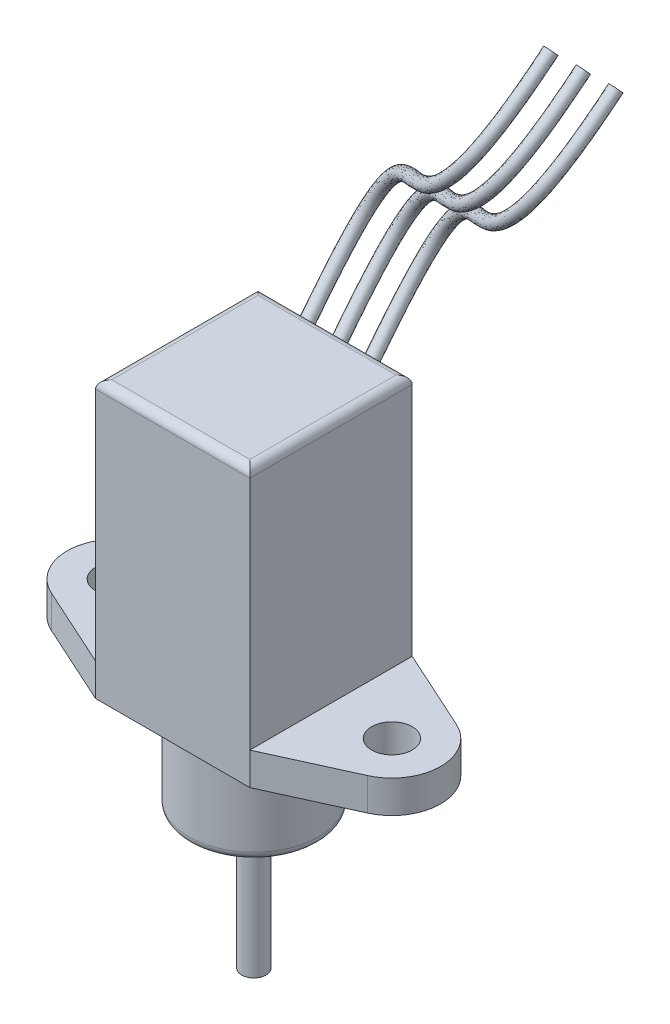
ISO-10303-21;
HEADER;
FILE_DESCRIPTION(('STEP AP214'),'2;1');
FILE_NAME('part.step','',(''),(''),'','','');
FILE_SCHEMA(('AUTOMOTIVE_DESIGN { 1 0 10303 214 1 1 1 1 }'));
ENDSEC;
DATA;
#1=APPLICATION_CONTEXT('core data for automotive mechanical design processes');
#2=APPLICATION_PROTOCOL_DEFINITION('international standard','automotive_design',2000,#1);
#3=PRODUCT_CONTEXT('',#1,'mechanical');
#4=PRODUCT('Part','Part','',(#3));
#5=PRODUCT_RELATED_PRODUCT_CATEGORY('part','',(#4));
#6=PRODUCT_DEFINITION_FORMATION('','',#4);
#7=PRODUCT_DEFINITION_CONTEXT('part definition',#1,'design');
#8=PRODUCT_DEFINITION('design','',#6,#7);
#9=PRODUCT_DEFINITION_SHAPE('','',#8);
#10=(LENGTH_UNIT() NAMED_UNIT(*) SI_UNIT(.MILLI.,.METRE.));
#11=(NAMED_UNIT(*) PLANE_ANGLE_UNIT() SI_UNIT($,.RADIAN.));
#12=(NAMED_UNIT(*) SI_UNIT($,.STERADIAN.) SOLID_ANGLE_UNIT());
#13=UNCERTAINTY_MEASURE_WITH_UNIT(LENGTH_MEASURE(1.E-05),#10,'distance_accuracy_value','');
#14=(GEOMETRIC_REPRESENTATION_CONTEXT(3) GLOBAL_UNCERTAINTY_ASSIGNED_CONTEXT((#13)) GLOBAL_UNIT_ASSIGNED_CONTEXT((#10,
#11,#12)) REPRESENTATION_CONTEXT('',''));
#15=CARTESIAN_POINT('',(0.,0.,0.));
#16=DIRECTION('',(0.,0.,1.));
#17=DIRECTION('',(1.,0.,0.));
#18=AXIS2_PLACEMENT_3D('',#15,#16,#17);
#19=CARTESIAN_POINT('',(0.,-12.,0.));
#20=DIRECTION('',(0.,-1.,0.));
#21=DIRECTION('',(0.,0.,-1.));
#22=AXIS2_PLACEMENT_3D('',#19,#20,#21);
#23=PLANE('',#22);
#24=DIRECTION('',(0.,0.,1.));
#25=VECTOR('',#24,1.);
#26=CARTESIAN_POINT('',(-0.749999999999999,-12.,-4.4370598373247));
#27=LINE('',#26,#25);
#28=CARTESIAN_POINT('',(-0.749999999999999,-12.,-6.45658578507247));
#29=VERTEX_POINT('',#28);
#30=CARTESIAN_POINT('',(-0.749999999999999,-12.,-4.4370598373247));
#31=VERTEX_POINT('',#30);
#32=EDGE_CURVE('E339',#29,#31,#27,.T.);
#33=ORIENTED_EDGE('',*,*,#32,.F.);
#34=CARTESIAN_POINT('',(0.,-12.,0.));
#35=DIRECTION('',(0.,-1.,0.));
#36=DIRECTION('',(0.,0.,-1.));
#37=AXIS2_PLACEMENT_3D('',#34,#35,#36);
#38=CIRCLE('',#37,6.5);
#39=CARTESIAN_POINT('',(-6.45658578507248,-12.,-0.750000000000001));
#40=VERTEX_POINT('',#39);
#41=EDGE_CURVE('E337',#40,#29,#38,.T.);
#42=ORIENTED_EDGE('',*,*,#41,.F.);
#43=DIRECTION('',(-1.,0.,0.));
#44=VECTOR('',#43,1.);
#45=CARTESIAN_POINT('',(-6.45658578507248,-12.,-0.750000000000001));
#46=LINE('',#45,#44);
#47=CARTESIAN_POINT('',(-4.43705983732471,-12.,-0.750000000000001));
#48=VERTEX_POINT('',#47);
#49=EDGE_CURVE('E345',#48,#40,#46,.T.);
#50=ORIENTED_EDGE('',*,*,#49,.F.);
#51=CARTESIAN_POINT('',(0.,-12.,0.));
#52=DIRECTION('',(0.,1.,0.));
#53=DIRECTION('',(0.,0.,-1.));
#54=AXIS2_PLACEMENT_3D('',#51,#52,#53);
#55=CIRCLE('',#54,4.5);
#56=EDGE_CURVE('E342',#31,#48,#55,.T.);
#57=ORIENTED_EDGE('',*,*,#56,.F.);
#58=EDGE_LOOP('',(#33,#42,#50,#57));
#59=FACE_BOUND('',#58,.T.);
#60=DIRECTION('',(1.,0.,0.));
#61=VECTOR('',#60,1.);
#62=CARTESIAN_POINT('',(-6.45658578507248,-12.,0.750000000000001));
#63=LINE('',#62,#61);
#64=CARTESIAN_POINT('',(-6.45658578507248,-12.,0.750000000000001));
#65=VERTEX_POINT('',#64);
#66=CARTESIAN_POINT('',(-4.43705983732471,-12.,0.750000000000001));
#67=VERTEX_POINT('',#66);
#68=EDGE_CURVE('E399',#65,#67,#63,.T.);
#69=ORIENTED_EDGE('',*,*,#68,.F.);
#70=CARTESIAN_POINT('',(0.,-12.,0.));
#71=DIRECTION('',(0.,-1.,0.));
#72=DIRECTION('',(0.,0.,-1.));
#73=AXIS2_PLACEMENT_3D('',#70,#71,#72);
#74=CIRCLE('',#73,6.5);
#75=CARTESIAN_POINT('',(-0.750000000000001,-12.,6.45658578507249));
#76=VERTEX_POINT('',#75);
#77=EDGE_CURVE('E397',#76,#65,#74,.T.);
#78=ORIENTED_EDGE('',*,*,#77,.F.);
#79=DIRECTION('',(0.,0.,1.));
#80=VECTOR('',#79,1.);
#81=CARTESIAN_POINT('',(-0.750000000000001,-12.,6.45658578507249));
#82=LINE('',#81,#80);
#83=CARTESIAN_POINT('',(-0.75,-12.,4.43705983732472));
#84=VERTEX_POINT('',#83);
#85=EDGE_CURVE('E405',#84,#76,#82,.T.);
#86=ORIENTED_EDGE('',*,*,#85,.F.);
#87=CARTESIAN_POINT('',(0.,-12.,0.));
#88=DIRECTION('',(0.,1.,0.));
#89=DIRECTION('',(0.,0.,-1.));
#90=AXIS2_PLACEMENT_3D('',#87,#88,#89);
#91=CIRCLE('',#90,4.5);
#92=EDGE_CURVE('E402',#67,#84,#91,.T.);
#93=ORIENTED_EDGE('',*,*,#92,.F.);
#94=EDGE_LOOP('',(#69,#78,#86,#93));
#95=FACE_BOUND('',#94,.T.);
#96=DIRECTION('',(0.,0.,-1.));
#97=VECTOR('',#96,1.);
#98=CARTESIAN_POINT('',(0.749999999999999,-12.,6.45658578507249));
#99=LINE('',#98,#97);
#100=CARTESIAN_POINT('',(0.749999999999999,-12.,6.45658578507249));
#101=VERTEX_POINT('',#100);
#102=CARTESIAN_POINT('',(0.749999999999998,-12.,4.43705983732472));
#103=VERTEX_POINT('',#102);
#104=EDGE_CURVE('E429',#101,#103,#99,.T.);
#105=ORIENTED_EDGE('',*,*,#104,.F.);
#106=CARTESIAN_POINT('',(0.,-12.,0.));
#107=DIRECTION('',(0.,-1.,0.));
#108=DIRECTION('',(0.,0.,-1.));
#109=AXIS2_PLACEMENT_3D('',#106,#107,#108);
#110=CIRCLE('',#109,6.5);
#111=CARTESIAN_POINT('',(6.45658578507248,-12.,0.750000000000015));
#112=VERTEX_POINT('',#111);
#113=EDGE_CURVE('E427',#112,#101,#110,.T.);
#114=ORIENTED_EDGE('',*,*,#113,.F.);
#115=DIRECTION('',(1.,0.,0.));
#116=VECTOR('',#115,1.);
#117=CARTESIAN_POINT('',(4.43705983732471,-12.,0.750000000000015));
#118=LINE('',#117,#116);
#119=CARTESIAN_POINT('',(4.43705983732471,-12.,0.750000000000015));
#120=VERTEX_POINT('',#119);
#121=EDGE_CURVE('E435',#120,#112,#118,.T.);
#122=ORIENTED_EDGE('',*,*,#121,.F.);
#123=CARTESIAN_POINT('',(0.,-12.,0.));
#124=DIRECTION('',(0.,1.,0.));
#125=DIRECTION('',(0.,0.,-1.));
#126=AXIS2_PLACEMENT_3D('',#123,#124,#125);
#127=CIRCLE('',#126,4.5);
#128=EDGE_CURVE('E432',#103,#120,#127,.T.);
#129=ORIENTED_EDGE('',*,*,#128,.F.);
#130=EDGE_LOOP('',(#105,#114,#122,#129));
#131=FACE_BOUND('',#130,.T.);
#132=DIRECTION('',(-1.,0.,0.));
#133=VECTOR('',#132,1.);
#134=CARTESIAN_POINT('',(4.43705983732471,-12.,-0.750000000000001));
#135=LINE('',#134,#133);
#136=CARTESIAN_POINT('',(6.45658578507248,-12.,-0.750000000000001));
#137=VERTEX_POINT('',#136);
#138=CARTESIAN_POINT('',(4.43705983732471,-12.,-0.750000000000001));
#139=VERTEX_POINT('',#138);
#140=EDGE_CURVE('E369',#137,#139,#135,.T.);
#141=ORIENTED_EDGE('',*,*,#140,.F.);
#142=CARTESIAN_POINT('',(0.,-12.,0.));
#143=DIRECTION('',(0.,-1.,0.));
#144=DIRECTION('',(0.,0.,-1.));
#145=AXIS2_PLACEMENT_3D('',#142,#143,#144);
#146=CIRCLE('',#145,6.5);
#147=CARTESIAN_POINT('',(0.75,-12.,-6.45658578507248));
#148=VERTEX_POINT('',#147);
#149=EDGE_CURVE('E367',#148,#137,#146,.T.);
#150=ORIENTED_EDGE('',*,*,#149,.F.);
#151=DIRECTION('',(0.,0.,-1.));
#152=VECTOR('',#151,1.);
#153=CARTESIAN_POINT('',(0.75,-12.,-4.43705983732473));
#154=LINE('',#153,#152);
#155=CARTESIAN_POINT('',(0.75,-12.,-4.43705983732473));
#156=VERTEX_POINT('',#155);
#157=EDGE_CURVE('E375',#156,#148,#154,.T.);
#158=ORIENTED_EDGE('',*,*,#157,.F.);
#159=CARTESIAN_POINT('',(0.,-12.,0.));
#160=DIRECTION('',(0.,1.,0.));
#161=DIRECTION('',(0.,0.,-1.));
#162=AXIS2_PLACEMENT_3D('',#159,#160,#161);
#163=CIRCLE('',#162,4.5);
#164=EDGE_CURVE('E372',#139,#156,#163,.T.);
#165=ORIENTED_EDGE('',*,*,#164,.F.);
#166=EDGE_LOOP('',(#141,#150,#158,#165));
#167=FACE_BOUND('',#166,.T.);
#168=CARTESIAN_POINT('',(0.,-12.,0.));
#169=DIRECTION('',(0.,-1.,0.));
#170=DIRECTION('',(0.,0.,-1.));
#171=AXIS2_PLACEMENT_3D('',#168,#169,#170);
#172=CIRCLE('',#171,7.);
#173=CARTESIAN_POINT('',(0.,-12.,-7.));
#174=VERTEX_POINT('',#173);
#175=EDGE_CURVE('E526',#174,#174,#172,.T.);
#176=ORIENTED_EDGE('',*,*,#175,.T.);
#177=EDGE_LOOP('',(#176));
#178=FACE_BOUND('',#177,.T.);
#179=CARTESIAN_POINT('',(0.,-12.,0.));
#180=DIRECTION('',(0.,-1.,0.));
#181=DIRECTION('',(0.,0.,-1.));
#182=AXIS2_PLACEMENT_3D('',#179,#180,#181);
#183=CIRCLE('',#182,1.5);
#184=CARTESIAN_POINT('',(0.,-12.,-1.5));
#185=VERTEX_POINT('',#184);
#186=EDGE_CURVE('E312',#185,#185,#183,.T.);
#187=ORIENTED_EDGE('',*,*,#186,.F.);
#188=EDGE_LOOP('',(#187));
#189=FACE_BOUND('',#188,.T.);
#190=ADVANCED_FACE('F90',(#59,#95,#131,#167,#178,#189),#23,.T.);
#191=CARTESIAN_POINT('',(17.,4.,0.));
#192=DIRECTION('',(0.,1.,0.));
#193=DIRECTION('',(0.,0.,1.));
#194=AXIS2_PLACEMENT_3D('',#191,#192,#193);
#195=PLANE('',#194);
#196=DIRECTION('',(0.,0.,1.));
#197=VECTOR('',#196,1.);
#198=CARTESIAN_POINT('',(-9.5,4.00000000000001,-10.));
#199=LINE('',#198,#197);
#200=CARTESIAN_POINT('',(-9.5,4.00000000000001,-10.));
#201=VERTEX_POINT('',#200);
#202=CARTESIAN_POINT('',(-9.5,4.00000000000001,10.));
#203=VERTEX_POINT('',#202);
#204=EDGE_CURVE('E321',#201,#203,#199,.T.);
#205=ORIENTED_EDGE('',*,*,#204,.F.);
#206=DIRECTION('',(-0.910361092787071,0.,0.413814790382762));
#207=VECTOR('',#206,1.);
#208=CARTESIAN_POINT('',(-9.5,4.00000000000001,-10.));
#209=LINE('',#208,#207);
#210=CARTESIAN_POINT('',(-19.4828887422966,4.00000000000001,-5.46216655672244));
#211=VERTEX_POINT('',#210);
#212=EDGE_CURVE('E469',#201,#211,#209,.T.);
#213=ORIENTED_EDGE('',*,*,#212,.T.);
#214=CARTESIAN_POINT('',(-17.,4.00000000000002,0.));
#215=DIRECTION('',(0.,1.,0.));
#216=DIRECTION('',(0.,0.,1.));
#217=AXIS2_PLACEMENT_3D('',#214,#215,#216);
#218=CIRCLE('',#217,6.);
#219=CARTESIAN_POINT('',(-19.4828887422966,3.99999999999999,5.46216655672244));
#220=VERTEX_POINT('',#219);
#221=EDGE_CURVE('E471',#211,#220,#218,.T.);
#222=ORIENTED_EDGE('',*,*,#221,.T.);
#223=DIRECTION('',(0.910361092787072,0.,0.413814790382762));
#224=VECTOR('',#223,1.);
#225=CARTESIAN_POINT('',(-19.4828887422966,3.99999999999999,5.46216655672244));
#226=LINE('',#225,#224);
#227=EDGE_CURVE('E474',#220,#203,#226,.T.);
#228=ORIENTED_EDGE('',*,*,#227,.T.);
#229=EDGE_LOOP('',(#205,#213,#222,#228));
#230=FACE_BOUND('',#229,.T.);
#231=CARTESIAN_POINT('',(-17.,4.00000000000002,0.));
#232=DIRECTION('',(0.,1.,0.));
#233=DIRECTION('',(0.,0.,1.));
#234=AXIS2_PLACEMENT_3D('',#231,#232,#233);
#235=CIRCLE('',#234,2.5);
#236=CARTESIAN_POINT('',(-17.,4.00000000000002,2.5));
#237=VERTEX_POINT('',#236);
#238=EDGE_CURVE('E457',#237,#237,#235,.T.);
#239=ORIENTED_EDGE('',*,*,#238,.F.);
#240=EDGE_LOOP('',(#239));
#241=FACE_BOUND('',#240,.T.);
#242=ADVANCED_FACE('F685',(#230,#241),#195,.T.);
#243=CARTESIAN_POINT('',(17.,0.,0.));
#244=DIRECTION('',(0.,1.,0.));
#245=DIRECTION('',(0.,0.,1.));
#246=AXIS2_PLACEMENT_3D('',#243,#244,#245);
#247=PLANE('',#246);
#248=CARTESIAN_POINT('',(-17.,0.,0.));
#249=DIRECTION('',(0.,1.,0.));
#250=DIRECTION('',(0.,0.,1.));
#251=AXIS2_PLACEMENT_3D('',#248,#249,#250);
#252=CIRCLE('',#251,2.5);
#253=CARTESIAN_POINT('',(-17.,0.,2.5));
#254=VERTEX_POINT('',#253);
#255=EDGE_CURVE('E456',#254,#254,#252,.T.);
#256=ORIENTED_EDGE('',*,*,#255,.T.);
#257=EDGE_LOOP('',(#256));
#258=FACE_BOUND('',#257,.T.);
#259=DIRECTION('',(-1.,0.,0.));
#260=VECTOR('',#259,1.);
#261=CARTESIAN_POINT('',(-9.5,0.,-10.));
#262=LINE('',#261,#260);
#263=CARTESIAN_POINT('',(9.5,0.,-10.));
#264=VERTEX_POINT('',#263);
#265=CARTESIAN_POINT('',(-9.5,0.,-10.));
#266=VERTEX_POINT('',#265);
#267=EDGE_CURVE('E466',#264,#266,#262,.T.);
#268=ORIENTED_EDGE('',*,*,#267,.F.);
#269=DIRECTION('',(-0.910361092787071,0.,-0.413814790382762));
#270=VECTOR('',#269,1.);
#271=CARTESIAN_POINT('',(19.4828887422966,0.,-5.46216655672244));
#272=LINE('',#271,#270);
#273=CARTESIAN_POINT('',(19.4828887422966,0.,-5.46216655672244));
#274=VERTEX_POINT('',#273);
#275=EDGE_CURVE('E472',#274,#264,#272,.T.);
#276=ORIENTED_EDGE('',*,*,#275,.F.);
#277=CARTESIAN_POINT('',(17.,0.,0.));
#278=DIRECTION('',(0.,1.,0.));
#279=DIRECTION('',(0.,0.,1.));
#280=AXIS2_PLACEMENT_3D('',#277,#278,#279);
#281=CIRCLE('',#280,6.);
#282=CARTESIAN_POINT('',(19.4828887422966,0.,5.46216655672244));
#283=VERTEX_POINT('',#282);
#284=EDGE_CURVE('E497',#283,#274,#281,.T.);
#285=ORIENTED_EDGE('',*,*,#284,.F.);
#286=DIRECTION('',(0.910361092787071,0.,-0.413814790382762));
#287=VECTOR('',#286,1.);
#288=CARTESIAN_POINT('',(9.5,0.,9.99999999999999));
#289=LINE('',#288,#287);
#290=CARTESIAN_POINT('',(9.5,0.,9.99999999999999));
#291=VERTEX_POINT('',#290);
#292=EDGE_CURVE('E495',#291,#283,#289,.T.);
#293=ORIENTED_EDGE('',*,*,#292,.F.);
#294=DIRECTION('',(1.,0.,0.));
#295=VECTOR('',#294,1.);
#296=CARTESIAN_POINT('',(-9.5,0.,9.99999999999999));
#297=LINE('',#296,#295);
#298=CARTESIAN_POINT('',(-9.5,0.,9.99999999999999));
#299=VERTEX_POINT('',#298);
#300=EDGE_CURVE('E493',#299,#291,#297,.T.);
#301=ORIENTED_EDGE('',*,*,#300,.F.);
#302=DIRECTION('',(0.910361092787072,0.,0.413814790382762));
#303=VECTOR('',#302,1.);
#304=CARTESIAN_POINT('',(-19.4828887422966,0.,5.46216655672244));
#305=LINE('',#304,#303);
#306=CARTESIAN_POINT('',(-19.4828887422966,0.,5.46216655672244));
#307=VERTEX_POINT('',#306);
#308=EDGE_CURVE('E491',#307,#299,#305,.T.);
#309=ORIENTED_EDGE('',*,*,#308,.F.);
#310=CARTESIAN_POINT('',(-17.,0.,0.));
#311=DIRECTION('',(0.,1.,0.));
#312=DIRECTION('',(0.,0.,1.));
#313=AXIS2_PLACEMENT_3D('',#310,#311,#312);
#314=CIRCLE('',#313,6.);
#315=CARTESIAN_POINT('',(-19.4828887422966,0.,-5.46216655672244));
#316=VERTEX_POINT('',#315);
#317=EDGE_CURVE('E489',#316,#307,#314,.T.);
#318=ORIENTED_EDGE('',*,*,#317,.F.);
#319=DIRECTION('',(-0.910361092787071,0.,0.413814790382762));
#320=VECTOR('',#319,1.);
#321=CARTESIAN_POINT('',(-9.5,0.,-10.));
#322=LINE('',#321,#320);
#323=EDGE_CURVE('E487',#266,#316,#322,.T.);
#324=ORIENTED_EDGE('',*,*,#323,.F.);
#325=EDGE_LOOP('',(#268,#276,#285,#293,#301,#309,#318,#324));
#326=FACE_BOUND('',#325,.T.);
#327=CARTESIAN_POINT('',(17.,0.,0.));
#328=DIRECTION('',(0.,1.,0.));
#329=DIRECTION('',(0.,0.,1.));
#330=AXIS2_PLACEMENT_3D('',#327,#328,#329);
#331=CIRCLE('',#330,2.5);
#332=CARTESIAN_POINT('',(17.,0.,2.5));
#333=VERTEX_POINT('',#332);
#334=EDGE_CURVE('E460',#333,#333,#331,.T.);
#335=ORIENTED_EDGE('',*,*,#334,.T.);
#336=EDGE_LOOP('',(#335));
#337=FACE_BOUND('',#336,.T.);
#338=CARTESIAN_POINT('',(0.,0.,0.));
#339=DIRECTION('',(0.,1.,0.));
#340=DIRECTION('',(0.,0.,1.));
#341=AXIS2_PLACEMENT_3D('',#338,#339,#340);
#342=CIRCLE('',#341,8.);
#343=CARTESIAN_POINT('',(0.,0.,8.00000000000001));
#344=VERTEX_POINT('',#343);
#345=EDGE_CURVE('E523',#344,#344,#342,.F.);
#346=ORIENTED_EDGE('',*,*,#345,.F.);
#347=EDGE_LOOP('',(#346));
#348=FACE_BOUND('',#347,.T.);
#349=ADVANCED_FACE('F702',(#258,#326,#337,#348),#247,.F.);
#350=DIRECTION('',(0.,0.,-1.));
#351=VECTOR('',#350,1.);
#352=CARTESIAN_POINT('',(9.5,4.00000000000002,-10.));
#353=LINE('',#352,#351);
#354=CARTESIAN_POINT('',(9.5,4.,10.));
#355=VERTEX_POINT('',#354);
#356=CARTESIAN_POINT('',(9.5,4.00000000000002,-10.));
#357=VERTEX_POINT('',#356);
#358=EDGE_CURVE('E324',#355,#357,#353,.T.);
#359=ORIENTED_EDGE('',*,*,#358,.F.);
#360=DIRECTION('',(0.910361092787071,0.,-0.413814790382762));
#361=VECTOR('',#360,1.);
#362=CARTESIAN_POINT('',(9.5,4.,10.));
#363=LINE('',#362,#361);
#364=CARTESIAN_POINT('',(19.4828887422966,4.,5.46216655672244));
#365=VERTEX_POINT('',#364);
#366=EDGE_CURVE('E477',#355,#365,#363,.T.);
#367=ORIENTED_EDGE('',*,*,#366,.T.);
#368=CARTESIAN_POINT('',(17.,4.,0.));
#369=DIRECTION('',(0.,1.,0.));
#370=DIRECTION('',(0.,0.,1.));
#371=AXIS2_PLACEMENT_3D('',#368,#369,#370);
#372=CIRCLE('',#371,6.);
#373=CARTESIAN_POINT('',(19.4828887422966,4.00000000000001,-5.46216655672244));
#374=VERTEX_POINT('',#373);
#375=EDGE_CURVE('E479',#365,#374,#372,.T.);
#376=ORIENTED_EDGE('',*,*,#375,.T.);
#377=DIRECTION('',(-0.910361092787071,0.,-0.413814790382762));
#378=VECTOR('',#377,1.);
#379=CARTESIAN_POINT('',(19.4828887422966,4.00000000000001,-5.46216655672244));
#380=LINE('',#379,#378);
#381=EDGE_CURVE('E481',#374,#357,#380,.T.);
#382=ORIENTED_EDGE('',*,*,#381,.T.);
#383=EDGE_LOOP('',(#359,#367,#376,#382));
#384=FACE_BOUND('',#383,.T.);
#385=CARTESIAN_POINT('',(17.,4.,0.));
#386=DIRECTION('',(0.,1.,0.));
#387=DIRECTION('',(0.,0.,1.));
#388=AXIS2_PLACEMENT_3D('',#385,#386,#387);
#389=CIRCLE('',#388,2.5);
#390=CARTESIAN_POINT('',(17.,4.,2.5));
#391=VERTEX_POINT('',#390);
#392=EDGE_CURVE('E463',#391,#391,#389,.T.);
#393=ORIENTED_EDGE('',*,*,#392,.F.);
#394=EDGE_LOOP('',(#393));
#395=FACE_BOUND('',#394,.T.);
#396=ADVANCED_FACE('F699',(#384,#395),#195,.T.);
#397=CARTESIAN_POINT('',(-9.5,4.00000000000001,-10.));
#398=DIRECTION('',(0.,0.,1.));
#399=DIRECTION('',(1.,0.,0.));
#400=AXIS2_PLACEMENT_3D('',#397,#398,#399);
#401=PLANE('',#400);
#402=CARTESIAN_POINT('',(2.0688214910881,28.9761932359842,-9.99999999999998));
#403=CARTESIAN_POINT('',(2.05431596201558,29.0358209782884,-9.99999999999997));
#404=CARTESIAN_POINT('',(2.04393664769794,29.0965204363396,-9.99999999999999));
#405=CARTESIAN_POINT('',(2.03193344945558,29.2191814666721,-10.0000000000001));
#406=CARTESIAN_POINT('',(2.03036885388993,29.2811487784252,-10.0000000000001));
#407=CARTESIAN_POINT('',(2.03655366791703,29.4016208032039,-10.0000000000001));
#408=CARTESIAN_POINT('',(2.04385310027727,29.460147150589,-10.));
#409=CARTESIAN_POINT('',(2.06774517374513,29.5752031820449,-10.));
#410=CARTESIAN_POINT('',(2.0843152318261,29.6317373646,-10.));
#411=CARTESIAN_POINT('',(2.12238914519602,29.7277249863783,-10.));
#412=CARTESIAN_POINT('',(2.14174963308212,29.768017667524,-10.));
#413=CARTESIAN_POINT('',(2.17539072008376,29.8257256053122,-10.));
#414=CARTESIAN_POINT('',(2.18736493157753,29.8444988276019,-10.));
#415=CARTESIAN_POINT('',(2.21288868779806,29.8809776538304,-10.));
#416=CARTESIAN_POINT('',(2.22644012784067,29.8986819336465,-10.));
#417=CARTESIAN_POINT('',(2.26401703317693,29.9433621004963,-10.));
#418=CARTESIAN_POINT('',(2.2893283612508,29.9692831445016,-10.));
#419=CARTESIAN_POINT('',(2.34385631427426,30.0165803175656,-10.));
#420=CARTESIAN_POINT('',(2.37306730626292,30.0379628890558,-10.));
#421=CARTESIAN_POINT('',(2.43510721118,30.0752793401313,-10.));
#422=CARTESIAN_POINT('',(2.46796063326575,30.0911729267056,-10.));
#423=CARTESIAN_POINT('',(2.53610049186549,30.1163781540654,-10.));
#424=CARTESIAN_POINT('',(2.57138552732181,30.1256935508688,-10.));
#425=CARTESIAN_POINT('',(2.63902879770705,30.1366961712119,-10.));
#426=CARTESIAN_POINT('',(2.67126956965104,30.139123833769,-10.));
#427=CARTESIAN_POINT('',(2.73569880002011,30.1386160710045,-10.));
#428=CARTESIAN_POINT('',(2.76788725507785,30.1356803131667,-10.));
#429=CARTESIAN_POINT('',(2.83195192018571,30.1247699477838,-10.));
#430=CARTESIAN_POINT('',(2.86381311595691,30.1167091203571,-10.));
#431=CARTESIAN_POINT('',(2.92605691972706,30.0960854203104,-10.));
#432=CARTESIAN_POINT('',(2.95643758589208,30.0835168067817,-9.99999999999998));
#433=CARTESIAN_POINT('',(3.02846282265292,30.0480476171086,-10.0000000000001));
#434=CARTESIAN_POINT('',(3.06907338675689,30.0230398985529,-10.0000000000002));
#435=CARTESIAN_POINT('',(3.14571942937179,29.9667777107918,-9.99999999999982));
#436=CARTESIAN_POINT('',(3.18174493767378,29.9355099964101,-9.99999999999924));
#437=CARTESIAN_POINT('',(3.25951036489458,29.8576652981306,-10.000000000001));
#438=CARTESIAN_POINT('',(3.29951538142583,29.8093582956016,-10.0000000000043));
#439=CARTESIAN_POINT('',(3.37120668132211,29.7069251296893,-9.99999999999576));
#440=CARTESIAN_POINT('',(3.4028823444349,29.6527916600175,-9.99999999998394));
#441=CARTESIAN_POINT('',(3.45114271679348,29.5542902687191,-10.0000000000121));
#442=CARTESIAN_POINT('',(3.4695231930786,29.5107861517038,-10.0000000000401));
#443=CARTESIAN_POINT('',(3.50140903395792,29.4222828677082,-9.99999999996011));
#444=CARTESIAN_POINT('',(3.51493956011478,29.3772927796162,-9.99999999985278));
#445=CARTESIAN_POINT('',(3.52607920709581,29.3317209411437,-9.99999999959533));
#446=B_SPLINE_CURVE_WITH_KNOTS('',3,(#402,#403,#404,#405,#406,#407,#408,#409,#410,#411,#412,
#413,#414,#415,#416,#417,#418,#419,#420,#421,#422,#423,#424,#425,#426,#427,#428,#429,#430,#431,
#432,#433,#434,#435,#436,#437,#438,#439,#440,#441,#442,#443,#444,#445),.UNSPECIFIED.,.F.,.F.,(4,
2,2,2,2,2,2,2,2,2,2,2,2,2,2,2,2,2,2,2,2,4),(0.,0.184058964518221,0.369354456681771,
0.545624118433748,0.721466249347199,0.855040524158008,0.921769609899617,0.988579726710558,
1.09680007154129,1.20486575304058,1.31370864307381,1.42248933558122,1.51902890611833,
1.61557446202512,1.71378881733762,1.81212870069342,1.95441810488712,2.09701181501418,
2.28418760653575,2.47160090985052,2.61301975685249,2.75369392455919),.UNSPECIFIED.);
#447=CARTESIAN_POINT('',(2.0688214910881,28.9761932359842,-9.99999999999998));
#448=VERTEX_POINT('',#447);
#449=CARTESIAN_POINT('',(3.52607920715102,29.3317209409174,-10.));
#450=VERTEX_POINT('',#449);
#451=EDGE_CURVE('E98',#448,#450,#446,.T.);
#452=ORIENTED_EDGE('',*,*,#451,.F.);
#453=DIRECTION('',(0.971505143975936,0.237018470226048,0.));
#454=VECTOR('',#453,1.);
#455=CARTESIAN_POINT('',(-14.6012242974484,24.9091959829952,-10.));
#456=LINE('',#455,#454);
#457=EDGE_CURVE('E12',#448,#450,#456,.T.);
#458=ORIENTED_EDGE('',*,*,#457,.T.);
#459=EDGE_LOOP('',(#452,#458));
#460=FACE_BOUND('',#459,.T.);
#461=CARTESIAN_POINT('',(-1.9311785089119,28.9761932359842,-9.99999999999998));
#462=CARTESIAN_POINT('',(-1.94568403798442,29.0358209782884,-9.99999999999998));
#463=CARTESIAN_POINT('',(-1.95606335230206,29.0965204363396,-10.));
#464=CARTESIAN_POINT('',(-1.96806655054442,29.2191814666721,-10.));
#465=CARTESIAN_POINT('',(-1.96963114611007,29.2811487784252,-10.0000000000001));
#466=CARTESIAN_POINT('',(-1.96344633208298,29.4016208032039,-10.0000000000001));
#467=CARTESIAN_POINT('',(-1.95614689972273,29.460147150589,-10.));
#468=CARTESIAN_POINT('',(-1.93225482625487,29.5752031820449,-10.));
#469=CARTESIAN_POINT('',(-1.9156847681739,29.6317373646,-10.));
#470=CARTESIAN_POINT('',(-1.87761085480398,29.7277249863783,-10.));
#471=CARTESIAN_POINT('',(-1.85825036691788,29.768017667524,-10.));
#472=CARTESIAN_POINT('',(-1.82460927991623,29.8257256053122,-10.));
#473=CARTESIAN_POINT('',(-1.81263506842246,29.8444988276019,-10.));
#474=CARTESIAN_POINT('',(-1.78711131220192,29.8809776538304,-10.));
#475=CARTESIAN_POINT('',(-1.77355987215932,29.8986819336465,-9.99999999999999));
#476=CARTESIAN_POINT('',(-1.73598296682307,29.9433621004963,-9.99999999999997));
#477=CARTESIAN_POINT('',(-1.7106716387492,29.9692831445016,-10.));
#478=CARTESIAN_POINT('',(-1.65614368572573,30.0165803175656,-10.));
#479=CARTESIAN_POINT('',(-1.62693269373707,30.0379628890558,-10.));
#480=CARTESIAN_POINT('',(-1.56489278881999,30.0752793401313,-10.));
#481=CARTESIAN_POINT('',(-1.53203936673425,30.0911729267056,-10.));
#482=CARTESIAN_POINT('',(-1.46389950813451,30.1163781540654,-10.));
#483=CARTESIAN_POINT('',(-1.42861447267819,30.1256935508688,-10.));
#484=CARTESIAN_POINT('',(-1.36097120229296,30.1366961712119,-10.));
#485=CARTESIAN_POINT('',(-1.32873043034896,30.139123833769,-10.));
#486=CARTESIAN_POINT('',(-1.26430119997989,30.1386160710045,-10.));
#487=CARTESIAN_POINT('',(-1.23211274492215,30.1356803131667,-9.99999999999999));
#488=CARTESIAN_POINT('',(-1.1680480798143,30.1247699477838,-10.));
#489=CARTESIAN_POINT('',(-1.1361868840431,30.1167091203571,-10.));
#490=CARTESIAN_POINT('',(-1.07394308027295,30.0960854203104,-10.));
#491=CARTESIAN_POINT('',(-1.04356241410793,30.0835168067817,-9.99999999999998));
#492=CARTESIAN_POINT('',(-0.971537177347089,30.0480476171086,-10.));
#493=CARTESIAN_POINT('',(-0.930926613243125,30.0230398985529,-10.0000000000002));
#494=CARTESIAN_POINT('',(-0.854280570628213,29.9667777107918,-9.99999999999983));
#495=CARTESIAN_POINT('',(-0.818255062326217,29.9355099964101,-9.99999999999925));
#496=CARTESIAN_POINT('',(-0.740489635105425,29.8576652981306,-10.000000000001));
#497=CARTESIAN_POINT('',(-0.700484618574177,29.8093582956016,-10.0000000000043));
#498=CARTESIAN_POINT('',(-0.628793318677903,29.7069251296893,-9.99999999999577));
#499=CARTESIAN_POINT('',(-0.597117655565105,29.6527916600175,-9.99999999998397));
#500=CARTESIAN_POINT('',(-0.548857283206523,29.5542902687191,-10.0000000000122));
#501=CARTESIAN_POINT('',(-0.530476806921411,29.5107861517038,-10.0000000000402));
#502=CARTESIAN_POINT('',(-0.498590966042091,29.4222828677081,-9.9999999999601));
#503=CARTESIAN_POINT('',(-0.485060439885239,29.3772927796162,-9.99999999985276));
#504=CARTESIAN_POINT('',(-0.473920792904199,29.3317209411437,-9.99999999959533));
#505=B_SPLINE_CURVE_WITH_KNOTS('',3,(#461,#462,#463,#464,#465,#466,#467,#468,#469,#470,#471,
#472,#473,#474,#475,#476,#477,#478,#479,#480,#481,#482,#483,#484,#485,#486,#487,#488,#489,#490,
#491,#492,#493,#494,#495,#496,#497,#498,#499,#500,#501,#502,#503,#504),.UNSPECIFIED.,.F.,.F.,(4,
2,2,2,2,2,2,2,2,2,2,2,2,2,2,2,2,2,2,2,2,4),(0.,0.184058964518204,0.369354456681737,
0.545624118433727,0.721466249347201,0.85504052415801,0.921769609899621,0.988579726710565,
1.09680007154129,1.20486575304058,1.3137086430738,1.42248933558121,1.51902890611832,
1.61557446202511,1.7137888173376,1.8121287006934,1.95441810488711,2.09701181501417,
2.28418760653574,2.47160090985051,2.61301975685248,2.75369392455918),.UNSPECIFIED.);
#506=CARTESIAN_POINT('',(-1.9311785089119,28.9761932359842,-9.99999999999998));
#507=VERTEX_POINT('',#506);
#508=CARTESIAN_POINT('',(-0.473920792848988,29.3317209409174,-10.));
#509=VERTEX_POINT('',#508);
#510=EDGE_CURVE('E109',#507,#509,#505,.T.);
#511=ORIENTED_EDGE('',*,*,#510,.F.);
#512=DIRECTION('',(0.971505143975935,0.237018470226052,0.));
#513=VECTOR('',#512,1.);
#514=CARTESIAN_POINT('',(-14.8259353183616,25.8302546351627,-10.));
#515=LINE('',#514,#513);
#516=EDGE_CURVE('E295',#507,#509,#515,.T.);
#517=ORIENTED_EDGE('',*,*,#516,.T.);
#518=EDGE_LOOP('',(#511,#517));
#519=FACE_BOUND('',#518,.T.);
#520=CARTESIAN_POINT('',(-5.93117850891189,28.9761932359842,-9.99999999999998));
#521=CARTESIAN_POINT('',(-5.94568403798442,29.0358209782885,-9.99999999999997));
#522=CARTESIAN_POINT('',(-5.95606335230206,29.0965204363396,-9.99999999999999));
#523=CARTESIAN_POINT('',(-5.96806655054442,29.2191814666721,-10.0000000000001));
#524=CARTESIAN_POINT('',(-5.96963114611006,29.2811487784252,-10.0000000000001));
#525=CARTESIAN_POINT('',(-5.96344633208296,29.4016208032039,-10.0000000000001));
#526=CARTESIAN_POINT('',(-5.95614689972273,29.460147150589,-10.));
#527=CARTESIAN_POINT('',(-5.93225482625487,29.5752031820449,-10.));
#528=CARTESIAN_POINT('',(-5.91568476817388,29.6317373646,-10.));
#529=CARTESIAN_POINT('',(-5.87761085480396,29.7277249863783,-10.));
#530=CARTESIAN_POINT('',(-5.85825036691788,29.768017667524,-10.));
#531=CARTESIAN_POINT('',(-5.82460927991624,29.8257256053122,-10.));
#532=CARTESIAN_POINT('',(-5.81263506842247,29.8444988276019,-10.));
#533=CARTESIAN_POINT('',(-5.78711131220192,29.8809776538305,-10.));
#534=CARTESIAN_POINT('',(-5.7735598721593,29.8986819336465,-9.99999999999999));
#535=CARTESIAN_POINT('',(-5.73598296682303,29.9433621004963,-9.99999999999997));
#536=CARTESIAN_POINT('',(-5.71067163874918,29.9692831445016,-10.));
#537=CARTESIAN_POINT('',(-5.65614368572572,30.0165803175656,-10.));
#538=CARTESIAN_POINT('',(-5.62693269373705,30.0379628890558,-9.99999999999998));
#539=CARTESIAN_POINT('',(-5.56489278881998,30.0752793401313,-9.99999999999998));
#540=CARTESIAN_POINT('',(-5.53203936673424,30.0911729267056,-10.));
#541=CARTESIAN_POINT('',(-5.4638995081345,30.1163781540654,-10.));
#542=CARTESIAN_POINT('',(-5.42861447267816,30.1256935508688,-9.99999999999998));
#543=CARTESIAN_POINT('',(-5.36097120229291,30.1366961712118,-9.99999999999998));
#544=CARTESIAN_POINT('',(-5.32873043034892,30.139123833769,-10.));
#545=CARTESIAN_POINT('',(-5.26430119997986,30.1386160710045,-10.));
#546=CARTESIAN_POINT('',(-5.23211274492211,30.1356803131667,-9.99999999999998));
#547=CARTESIAN_POINT('',(-5.16804807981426,30.1247699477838,-9.99999999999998));
#548=CARTESIAN_POINT('',(-5.13618688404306,30.1167091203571,-10.));
#549=CARTESIAN_POINT('',(-5.0739430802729,30.0960854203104,-10.));
#550=CARTESIAN_POINT('',(-5.04356241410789,30.0835168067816,-9.99999999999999));
#551=CARTESIAN_POINT('',(-4.97153717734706,30.0480476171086,-10.0000000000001));
#552=CARTESIAN_POINT('',(-4.9309266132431,30.0230398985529,-10.0000000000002));
#553=CARTESIAN_POINT('',(-4.85428057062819,29.9667777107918,-9.99999999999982));
#554=CARTESIAN_POINT('',(-4.8182550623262,29.9355099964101,-9.99999999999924));
#555=CARTESIAN_POINT('',(-4.74048963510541,29.8576652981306,-10.000000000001));
#556=CARTESIAN_POINT('',(-4.70048461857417,29.8093582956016,-10.0000000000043));
#557=CARTESIAN_POINT('',(-4.6287933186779,29.7069251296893,-9.99999999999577));
#558=CARTESIAN_POINT('',(-4.59711765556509,29.6527916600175,-9.99999999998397));
#559=CARTESIAN_POINT('',(-4.54885728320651,29.5542902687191,-10.0000000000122));
#560=CARTESIAN_POINT('',(-4.5304768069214,29.5107861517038,-10.0000000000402));
#561=CARTESIAN_POINT('',(-4.49859096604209,29.4222828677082,-9.9999999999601));
#562=CARTESIAN_POINT('',(-4.48506043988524,29.3772927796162,-9.99999999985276));
#563=CARTESIAN_POINT('',(-4.47392079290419,29.3317209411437,-9.99999999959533));
#564=B_SPLINE_CURVE_WITH_KNOTS('',3,(#520,#521,#522,#523,#524,#525,#526,#527,#528,#529,#530,
#531,#532,#533,#534,#535,#536,#537,#538,#539,#540,#541,#542,#543,#544,#545,#546,#547,#548,#549,
#550,#551,#552,#553,#554,#555,#556,#557,#558,#559,#560,#561,#562,#563),.UNSPECIFIED.,.F.,.F.,(4,
2,2,2,2,2,2,2,2,2,2,2,2,2,2,2,2,2,2,2,2,4),(0.,0.184058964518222,0.369354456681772,
0.545624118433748,0.721466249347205,0.855040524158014,0.92176960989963,0.988579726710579,
1.0968000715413,1.20486575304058,1.31370864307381,1.42248933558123,1.51902890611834,
1.61557446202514,1.71378881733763,1.81212870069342,1.95441810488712,2.09701181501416,
2.28418760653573,2.47160090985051,2.61301975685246,2.75369392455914),.UNSPECIFIED.);
#565=CARTESIAN_POINT('',(-5.93117850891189,28.9761932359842,-9.99999999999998));
#566=VERTEX_POINT('',#565);
#567=CARTESIAN_POINT('',(-4.47392079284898,29.3317209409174,-10.));
#568=VERTEX_POINT('',#567);
#569=EDGE_CURVE('E550',#566,#568,#564,.T.);
#570=ORIENTED_EDGE('',*,*,#569,.F.);
#571=DIRECTION('',(0.971505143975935,0.23701847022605,0.));
#572=VECTOR('',#571,1.);
#573=CARTESIAN_POINT('',(-15.0506463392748,26.7513132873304,-10.));
#574=LINE('',#573,#572);
#575=EDGE_CURVE('E566',#566,#568,#574,.T.);
#576=ORIENTED_EDGE('',*,*,#575,.T.);
#577=EDGE_LOOP('',(#570,#576));
#578=FACE_BOUND('',#577,.T.);
#579=DIRECTION('',(0.,-1.,0.));
#580=VECTOR('',#579,1.);
#581=CARTESIAN_POINT('',(-9.5,34.0000000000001,-10.));
#582=LINE('',#581,#580);
#583=CARTESIAN_POINT('',(-9.5,33.,-10.));
#584=VERTEX_POINT('',#583);
#585=EDGE_CURVE('E328',#584,#201,#582,.T.);
#586=ORIENTED_EDGE('',*,*,#585,.F.);
#587=DIRECTION('',(-1.,0.,0.));
#588=VECTOR('',#587,1.);
#589=CARTESIAN_POINT('',(9.5,33.,-10.));
#590=LINE('',#589,#588);
#591=CARTESIAN_POINT('',(9.5,33.0000000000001,-10.));
#592=VERTEX_POINT('',#591);
#593=EDGE_CURVE('E541',#584,#592,#590,.F.);
#594=ORIENTED_EDGE('',*,*,#593,.T.);
#595=DIRECTION('',(0.,-1.,0.));
#596=VECTOR('',#595,1.);
#597=CARTESIAN_POINT('',(9.5,34.0000000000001,-10.));
#598=LINE('',#597,#596);
#599=EDGE_CURVE('E330',#592,#357,#598,.T.);
#600=ORIENTED_EDGE('',*,*,#599,.T.);
#601=DIRECTION('',(0.,-1.,0.));
#602=VECTOR('',#601,1.);
#603=CARTESIAN_POINT('',(9.5,4.00000000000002,-10.));
#604=LINE('',#603,#602);
#605=EDGE_CURVE('E484',#357,#264,#604,.T.);
#606=ORIENTED_EDGE('',*,*,#605,.T.);
#607=ORIENTED_EDGE('',*,*,#267,.T.);
#608=DIRECTION('',(0.,-1.,0.));
#609=VECTOR('',#608,1.);
#610=CARTESIAN_POINT('',(-9.5,4.00000000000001,-10.));
#611=LINE('',#610,#609);
#612=EDGE_CURVE('E520',#201,#266,#611,.T.);
#613=ORIENTED_EDGE('',*,*,#612,.F.);
#614=EDGE_LOOP('',(#586,#594,#600,#606,#607,#613));
#615=FACE_BOUND('',#614,.T.);
#616=ADVANCED_FACE('F288',(#460,#519,#578,#615),#401,.F.);
#617=CARTESIAN_POINT('',(-9.5,4.00000000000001,-10.));
#618=DIRECTION('',(0.413814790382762,0.,0.910361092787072));
#619=DIRECTION('',(0.910361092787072,0.,-0.413814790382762));
#620=AXIS2_PLACEMENT_3D('',#617,#618,#619);
#621=PLANE('',#620);
#622=ORIENTED_EDGE('',*,*,#323,.T.);
#623=DIRECTION('',(0.,-1.,0.));
#624=VECTOR('',#623,1.);
#625=CARTESIAN_POINT('',(-19.4828887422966,4.00000000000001,-5.46216655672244));
#626=LINE('',#625,#624);
#627=EDGE_CURVE('E517',#211,#316,#626,.T.);
#628=ORIENTED_EDGE('',*,*,#627,.F.);
#629=ORIENTED_EDGE('',*,*,#212,.F.);
#630=ORIENTED_EDGE('',*,*,#612,.T.);
#631=EDGE_LOOP('',(#622,#628,#629,#630));
#632=FACE_BOUND('',#631,.T.);
#633=ADVANCED_FACE('F729',(#632),#621,.F.);
#634=CARTESIAN_POINT('',(-17.,4.00000000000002,0.));
#635=DIRECTION('',(0.,-1.,0.));
#636=DIRECTION('',(0.,0.,-1.));
#637=AXIS2_PLACEMENT_3D('',#634,#635,#636);
#638=CYLINDRICAL_SURFACE('',#637,6.);
#639=ORIENTED_EDGE('',*,*,#317,.T.);
#640=DIRECTION('',(0.,-1.,0.));
#641=VECTOR('',#640,1.);
#642=CARTESIAN_POINT('',(-19.4828887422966,3.99999999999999,5.46216655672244));
#643=LINE('',#642,#641);
#644=EDGE_CURVE('E514',#220,#307,#643,.T.);
#645=ORIENTED_EDGE('',*,*,#644,.F.);
#646=ORIENTED_EDGE('',*,*,#221,.F.);
#647=ORIENTED_EDGE('',*,*,#627,.T.);
#648=EDGE_LOOP('',(#639,#645,#646,#647));
#649=FACE_BOUND('',#648,.T.);
#650=ADVANCED_FACE('F726',(#649),#638,.T.);
#651=CARTESIAN_POINT('',(-19.4828887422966,3.99999999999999,5.46216655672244));
#652=DIRECTION('',(0.413814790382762,0.,-0.910361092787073));
#653=DIRECTION('',(-0.910361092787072,0.,-0.413814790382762));
#654=AXIS2_PLACEMENT_3D('',#651,#652,#653);
#655=PLANE('',#654);
#656=ORIENTED_EDGE('',*,*,#308,.T.);
#657=DIRECTION('',(0.,-1.,0.));
#658=VECTOR('',#657,1.);
#659=CARTESIAN_POINT('',(-9.5,4.00000000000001,10.));
#660=LINE('',#659,#658);
#661=EDGE_CURVE('E511',#203,#299,#660,.T.);
#662=ORIENTED_EDGE('',*,*,#661,.F.);
#663=ORIENTED_EDGE('',*,*,#227,.F.);
#664=ORIENTED_EDGE('',*,*,#644,.T.);
#665=EDGE_LOOP('',(#656,#662,#663,#664));
#666=FACE_BOUND('',#665,.T.);
#667=ADVANCED_FACE('F722',(#666),#655,.F.);
#668=CARTESIAN_POINT('',(-9.5,4.00000000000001,10.));
#669=DIRECTION('',(0.,0.,-1.));
#670=DIRECTION('',(-1.,0.,0.));
#671=AXIS2_PLACEMENT_3D('',#668,#669,#670);
#672=PLANE('',#671);
#673=DIRECTION('',(0.,-1.,0.));
#674=VECTOR('',#673,1.);
#675=CARTESIAN_POINT('',(9.5,34.0000000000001,9.99999999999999));
#676=LINE('',#675,#674);
#677=CARTESIAN_POINT('',(9.5,33.0000000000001,10.));
#678=VERTEX_POINT('',#677);
#679=EDGE_CURVE('E332',#678,#355,#676,.T.);
#680=ORIENTED_EDGE('',*,*,#679,.F.);
#681=DIRECTION('',(1.,0.,0.));
#682=VECTOR('',#681,1.);
#683=CARTESIAN_POINT('',(-9.5,33.,10.));
#684=LINE('',#683,#682);
#685=CARTESIAN_POINT('',(-9.5,33.,10.));
#686=VERTEX_POINT('',#685);
#687=EDGE_CURVE('E548',#678,#686,#684,.F.);
#688=ORIENTED_EDGE('',*,*,#687,.T.);
#689=DIRECTION('',(0.,-1.,0.));
#690=VECTOR('',#689,1.);
#691=CARTESIAN_POINT('',(-9.5,34.,10.));
#692=LINE('',#691,#690);
#693=EDGE_CURVE('E334',#686,#203,#692,.T.);
#694=ORIENTED_EDGE('',*,*,#693,.T.);
#695=ORIENTED_EDGE('',*,*,#661,.T.);
#696=ORIENTED_EDGE('',*,*,#300,.T.);
#697=DIRECTION('',(0.,-1.,0.));
#698=VECTOR('',#697,1.);
#699=CARTESIAN_POINT('',(9.5,4.,10.));
#700=LINE('',#699,#698);
#701=EDGE_CURVE('E508',#355,#291,#700,.T.);
#702=ORIENTED_EDGE('',*,*,#701,.F.);
#703=EDGE_LOOP('',(#680,#688,#694,#695,#696,#702));
#704=FACE_BOUND('',#703,.T.);
#705=ADVANCED_FACE('F718',(#704),#672,.F.);
#706=CARTESIAN_POINT('',(9.5,4.,10.));
#707=DIRECTION('',(-0.413814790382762,0.,-0.910361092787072));
#708=DIRECTION('',(-0.910361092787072,0.,0.413814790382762));
#709=AXIS2_PLACEMENT_3D('',#706,#707,#708);
#710=PLANE('',#709);
#711=ORIENTED_EDGE('',*,*,#292,.T.);
#712=DIRECTION('',(0.,-1.,0.));
#713=VECTOR('',#712,1.);
#714=CARTESIAN_POINT('',(19.4828887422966,4.,5.46216655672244));
#715=LINE('',#714,#713);
#716=EDGE_CURVE('E505',#365,#283,#715,.T.);
#717=ORIENTED_EDGE('',*,*,#716,.F.);
#718=ORIENTED_EDGE('',*,*,#366,.F.);
#719=ORIENTED_EDGE('',*,*,#701,.T.);
#720=EDGE_LOOP('',(#711,#717,#718,#719));
#721=FACE_BOUND('',#720,.T.);
#722=ADVANCED_FACE('F714',(#721),#710,.F.);
#723=CARTESIAN_POINT('',(17.,4.,0.));
#724=DIRECTION('',(0.,-1.,0.));
#725=DIRECTION('',(0.,0.,-1.));
#726=AXIS2_PLACEMENT_3D('',#723,#724,#725);
#727=CYLINDRICAL_SURFACE('',#726,6.);
#728=ORIENTED_EDGE('',*,*,#284,.T.);
#729=DIRECTION('',(0.,-1.,0.));
#730=VECTOR('',#729,1.);
#731=CARTESIAN_POINT('',(19.4828887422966,4.00000000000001,-5.46216655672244));
#732=LINE('',#731,#730);
#733=EDGE_CURVE('E502',#374,#274,#732,.T.);
#734=ORIENTED_EDGE('',*,*,#733,.F.);
#735=ORIENTED_EDGE('',*,*,#375,.F.);
#736=ORIENTED_EDGE('',*,*,#716,.T.);
#737=EDGE_LOOP('',(#728,#734,#735,#736));
#738=FACE_BOUND('',#737,.T.);
#739=ADVANCED_FACE('F710',(#738),#727,.T.);
#740=CARTESIAN_POINT('',(19.4828887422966,4.00000000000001,-5.46216655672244));
#741=DIRECTION('',(-0.413814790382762,0.,0.910361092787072));
#742=DIRECTION('',(0.910361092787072,0.,0.413814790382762));
#743=AXIS2_PLACEMENT_3D('',#740,#741,#742);
#744=PLANE('',#743);
#745=ORIENTED_EDGE('',*,*,#275,.T.);
#746=ORIENTED_EDGE('',*,*,#605,.F.);
#747=ORIENTED_EDGE('',*,*,#381,.F.);
#748=ORIENTED_EDGE('',*,*,#733,.T.);
#749=EDGE_LOOP('',(#745,#746,#747,#748));
#750=FACE_BOUND('',#749,.T.);
#751=ADVANCED_FACE('F697',(#750),#744,.F.);
#752=CARTESIAN_POINT('',(17.,4.,0.));
#753=DIRECTION('',(0.,-1.,0.));
#754=DIRECTION('',(0.,0.,-1.));
#755=AXIS2_PLACEMENT_3D('',#752,#753,#754);
#756=CYLINDRICAL_SURFACE('',#755,2.5);
#757=ORIENTED_EDGE('',*,*,#392,.T.);
#758=EDGE_LOOP('',(#757));
#759=FACE_BOUND('',#758,.T.);
#760=ORIENTED_EDGE('',*,*,#334,.F.);
#761=EDGE_LOOP('',(#760));
#762=FACE_BOUND('',#761,.T.);
#763=ADVANCED_FACE('F693',(#759,#762),#756,.F.);
#764=CARTESIAN_POINT('',(-17.,4.00000000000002,0.));
#765=DIRECTION('',(0.,-1.,0.));
#766=DIRECTION('',(0.,0.,-1.));
#767=AXIS2_PLACEMENT_3D('',#764,#765,#766);
#768=CYLINDRICAL_SURFACE('',#767,2.5);
#769=ORIENTED_EDGE('',*,*,#238,.T.);
#770=EDGE_LOOP('',(#769));
#771=FACE_BOUND('',#770,.T.);
#772=ORIENTED_EDGE('',*,*,#255,.F.);
#773=EDGE_LOOP('',(#772));
#774=FACE_BOUND('',#773,.T.);
#775=ADVANCED_FACE('F689',(#771,#774),#768,.F.);
#776=CARTESIAN_POINT('',(0.,-12.,0.));
#777=DIRECTION('',(0.,1.,0.));
#778=DIRECTION('',(0.,0.,1.));
#779=AXIS2_PLACEMENT_3D('',#776,#777,#778);
#780=CYLINDRICAL_SURFACE('',#779,8.);
#781=CARTESIAN_POINT('',(0.,-11.,0.));
#782=DIRECTION('',(0.,-1.,0.));
#783=DIRECTION('',(0.,0.,-1.));
#784=AXIS2_PLACEMENT_3D('',#781,#782,#783);
#785=CIRCLE('',#784,8.);
#786=CARTESIAN_POINT('',(0.,-11.,-7.99999999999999));
#787=VERTEX_POINT('',#786);
#788=EDGE_CURVE('E529',#787,#787,#785,.F.);
#789=ORIENTED_EDGE('',*,*,#788,.T.);
#790=EDGE_LOOP('',(#789));
#791=FACE_BOUND('',#790,.T.);
#792=ORIENTED_EDGE('',*,*,#345,.T.);
#793=EDGE_LOOP('',(#792));
#794=FACE_BOUND('',#793,.T.);
#795=ADVANCED_FACE('F681',(#791,#794),#780,.T.);
#796=CARTESIAN_POINT('',(0.,-12.,0.));
#797=DIRECTION('',(0.,1.,0.));
#798=DIRECTION('',(0.,0.,1.));
#799=AXIS2_PLACEMENT_3D('',#796,#797,#798);
#800=CYLINDRICAL_SURFACE('',#799,6.5);
#801=CARTESIAN_POINT('',(0.,0.,0.));
#802=DIRECTION('',(0.,-1.,0.));
#803=DIRECTION('',(0.,0.,-1.));
#804=AXIS2_PLACEMENT_3D('',#801,#802,#803);
#805=CIRCLE('',#804,6.5);
#806=CARTESIAN_POINT('',(6.45658578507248,0.,0.750000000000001));
#807=VERTEX_POINT('',#806);
#808=CARTESIAN_POINT('',(0.749999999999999,0.,6.45658578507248));
#809=VERTEX_POINT('',#808);
#810=EDGE_CURVE('E426',#807,#809,#805,.T.);
#811=ORIENTED_EDGE('',*,*,#810,.F.);
#812=DIRECTION('',(0.,1.,0.));
#813=VECTOR('',#812,1.);
#814=CARTESIAN_POINT('',(6.45658578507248,-12.,0.750000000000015));
#815=LINE('',#814,#813);
#816=EDGE_CURVE('E437',#112,#807,#815,.T.);
#817=ORIENTED_EDGE('',*,*,#816,.F.);
#818=ORIENTED_EDGE('',*,*,#113,.T.);
#819=DIRECTION('',(0.,1.,0.));
#820=VECTOR('',#819,1.);
#821=CARTESIAN_POINT('',(0.749999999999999,-12.,6.45658578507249));
#822=LINE('',#821,#820);
#823=EDGE_CURVE('E453',#101,#809,#822,.T.);
#824=ORIENTED_EDGE('',*,*,#823,.T.);
#825=EDGE_LOOP('',(#811,#817,#818,#824));
#826=FACE_BOUND('',#825,.T.);
#827=ADVANCED_FACE('F677',(#826),#800,.F.);
#828=CARTESIAN_POINT('',(0.749999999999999,-12.,6.45658578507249));
#829=DIRECTION('',(1.,0.,0.));
#830=DIRECTION('',(0.,0.,-1.));
#831=AXIS2_PLACEMENT_3D('',#828,#829,#830);
#832=PLANE('',#831);
#833=DIRECTION('',(0.,0.,-1.));
#834=VECTOR('',#833,1.);
#835=CARTESIAN_POINT('',(0.749999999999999,0.,6.45658578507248));
#836=LINE('',#835,#834);
#837=CARTESIAN_POINT('',(0.749999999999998,0.,4.4370598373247));
#838=VERTEX_POINT('',#837);
#839=EDGE_CURVE('E440',#809,#838,#836,.T.);
#840=ORIENTED_EDGE('',*,*,#839,.F.);
#841=ORIENTED_EDGE('',*,*,#823,.F.);
#842=ORIENTED_EDGE('',*,*,#104,.T.);
#843=DIRECTION('',(0.,1.,0.));
#844=VECTOR('',#843,1.);
#845=CARTESIAN_POINT('',(0.749999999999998,-12.,4.43705983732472));
#846=LINE('',#845,#844);
#847=EDGE_CURVE('E451',#103,#838,#846,.T.);
#848=ORIENTED_EDGE('',*,*,#847,.T.);
#849=EDGE_LOOP('',(#840,#841,#842,#848));
#850=FACE_BOUND('',#849,.T.);
#851=ADVANCED_FACE('F673',(#850),#832,.T.);
#852=CARTESIAN_POINT('',(0.,-12.,0.));
#853=DIRECTION('',(0.,1.,0.));
#854=DIRECTION('',(0.,0.,1.));
#855=AXIS2_PLACEMENT_3D('',#852,#853,#854);
#856=CYLINDRICAL_SURFACE('',#855,4.5);
#857=CARTESIAN_POINT('',(0.,0.,0.));
#858=DIRECTION('',(0.,1.,0.));
#859=DIRECTION('',(0.,0.,-1.));
#860=AXIS2_PLACEMENT_3D('',#857,#858,#859);
#861=CIRCLE('',#860,4.5);
#862=CARTESIAN_POINT('',(4.43705983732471,0.,0.750000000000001));
#863=VERTEX_POINT('',#862);
#864=EDGE_CURVE('E443',#838,#863,#861,.T.);
#865=ORIENTED_EDGE('',*,*,#864,.F.);
#866=ORIENTED_EDGE('',*,*,#847,.F.);
#867=ORIENTED_EDGE('',*,*,#128,.T.);
#868=DIRECTION('',(0.,1.,0.));
#869=VECTOR('',#868,1.);
#870=CARTESIAN_POINT('',(4.43705983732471,-12.,0.750000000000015));
#871=LINE('',#870,#869);
#872=EDGE_CURVE('E449',#120,#863,#871,.T.);
#873=ORIENTED_EDGE('',*,*,#872,.T.);
#874=EDGE_LOOP('',(#865,#866,#867,#873));
#875=FACE_BOUND('',#874,.T.);
#876=ADVANCED_FACE('F669',(#875),#856,.T.);
#877=CARTESIAN_POINT('',(4.43705983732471,-12.,0.750000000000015));
#878=DIRECTION('',(0.,0.,1.));
#879=DIRECTION('',(1.,0.,0.));
#880=AXIS2_PLACEMENT_3D('',#877,#878,#879);
#881=PLANE('',#880);
#882=DIRECTION('',(1.,0.,0.));
#883=VECTOR('',#882,1.);
#884=CARTESIAN_POINT('',(4.43705983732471,0.,0.750000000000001));
#885=LINE('',#884,#883);
#886=EDGE_CURVE('E430',#863,#807,#885,.T.);
#887=ORIENTED_EDGE('',*,*,#886,.F.);
#888=ORIENTED_EDGE('',*,*,#872,.F.);
#889=ORIENTED_EDGE('',*,*,#121,.T.);
#890=ORIENTED_EDGE('',*,*,#816,.T.);
#891=EDGE_LOOP('',(#887,#888,#889,#890));
#892=FACE_BOUND('',#891,.T.);
#893=ADVANCED_FACE('F665',(#892),#881,.T.);
#894=CARTESIAN_POINT('',(0.,-12.,0.));
#895=DIRECTION('',(0.,1.,0.));
#896=DIRECTION('',(0.,0.,1.));
#897=AXIS2_PLACEMENT_3D('',#894,#895,#896);
#898=CYLINDRICAL_SURFACE('',#897,6.5);
#899=CARTESIAN_POINT('',(0.,0.,0.));
#900=DIRECTION('',(0.,-1.,0.));
#901=DIRECTION('',(0.,0.,-1.));
#902=AXIS2_PLACEMENT_3D('',#899,#900,#901);
#903=CIRCLE('',#902,6.5);
#904=CARTESIAN_POINT('',(-0.750000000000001,0.,6.45658578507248));
#905=VERTEX_POINT('',#904);
#906=CARTESIAN_POINT('',(-6.45658578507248,0.,0.750000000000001));
#907=VERTEX_POINT('',#906);
#908=EDGE_CURVE('E396',#905,#907,#903,.T.);
#909=ORIENTED_EDGE('',*,*,#908,.F.);
#910=DIRECTION('',(0.,1.,0.));
#911=VECTOR('',#910,1.);
#912=CARTESIAN_POINT('',(-0.750000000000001,-12.,6.45658578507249));
#913=LINE('',#912,#911);
#914=EDGE_CURVE('E407',#76,#905,#913,.T.);
#915=ORIENTED_EDGE('',*,*,#914,.F.);
#916=ORIENTED_EDGE('',*,*,#77,.T.);
#917=DIRECTION('',(0.,1.,0.));
#918=VECTOR('',#917,1.);
#919=CARTESIAN_POINT('',(-6.45658578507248,-12.,0.750000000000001));
#920=LINE('',#919,#918);
#921=EDGE_CURVE('E423',#65,#907,#920,.T.);
#922=ORIENTED_EDGE('',*,*,#921,.T.);
#923=EDGE_LOOP('',(#909,#915,#916,#922));
#924=FACE_BOUND('',#923,.T.);
#925=ADVANCED_FACE('F661',(#924),#898,.F.);
#926=CARTESIAN_POINT('',(-6.45658578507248,-12.,0.750000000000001));
#927=DIRECTION('',(0.,0.,1.));
#928=DIRECTION('',(1.,0.,0.));
#929=AXIS2_PLACEMENT_3D('',#926,#927,#928);
#930=PLANE('',#929);
#931=DIRECTION('',(1.,0.,0.));
#932=VECTOR('',#931,1.);
#933=CARTESIAN_POINT('',(-6.45658578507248,0.,0.750000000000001));
#934=LINE('',#933,#932);
#935=CARTESIAN_POINT('',(-4.43705983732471,0.,0.750000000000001));
#936=VERTEX_POINT('',#935);
#937=EDGE_CURVE('E410',#907,#936,#934,.T.);
#938=ORIENTED_EDGE('',*,*,#937,.F.);
#939=ORIENTED_EDGE('',*,*,#921,.F.);
#940=ORIENTED_EDGE('',*,*,#68,.T.);
#941=DIRECTION('',(0.,1.,0.));
#942=VECTOR('',#941,1.);
#943=CARTESIAN_POINT('',(-4.43705983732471,-12.,0.750000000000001));
#944=LINE('',#943,#942);
#945=EDGE_CURVE('E421',#67,#936,#944,.T.);
#946=ORIENTED_EDGE('',*,*,#945,.T.);
#947=EDGE_LOOP('',(#938,#939,#940,#946));
#948=FACE_BOUND('',#947,.T.);
#949=ADVANCED_FACE('F657',(#948),#930,.T.);
#950=CARTESIAN_POINT('',(0.,-12.,0.));
#951=DIRECTION('',(0.,1.,0.));
#952=DIRECTION('',(0.,0.,1.));
#953=AXIS2_PLACEMENT_3D('',#950,#951,#952);
#954=CYLINDRICAL_SURFACE('',#953,4.5);
#955=CARTESIAN_POINT('',(0.,0.,0.));
#956=DIRECTION('',(0.,1.,0.));
#957=DIRECTION('',(0.,0.,-1.));
#958=AXIS2_PLACEMENT_3D('',#955,#956,#957);
#959=CIRCLE('',#958,4.5);
#960=CARTESIAN_POINT('',(-0.75,0.,4.43705983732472));
#961=VERTEX_POINT('',#960);
#962=EDGE_CURVE('E413',#936,#961,#959,.T.);
#963=ORIENTED_EDGE('',*,*,#962,.F.);
#964=ORIENTED_EDGE('',*,*,#945,.F.);
#965=ORIENTED_EDGE('',*,*,#92,.T.);
#966=DIRECTION('',(0.,1.,0.));
#967=VECTOR('',#966,1.);
#968=CARTESIAN_POINT('',(-0.75,-12.,4.43705983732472));
#969=LINE('',#968,#967);
#970=EDGE_CURVE('E419',#84,#961,#969,.T.);
#971=ORIENTED_EDGE('',*,*,#970,.T.);
#972=EDGE_LOOP('',(#963,#964,#965,#971));
#973=FACE_BOUND('',#972,.T.);
#974=ADVANCED_FACE('F653',(#973),#954,.T.);
#975=CARTESIAN_POINT('',(-0.750000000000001,-12.,6.45658578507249));
#976=DIRECTION('',(-1.,0.,0.));
#977=DIRECTION('',(0.,0.,1.));
#978=AXIS2_PLACEMENT_3D('',#975,#976,#977);
#979=PLANE('',#978);
#980=DIRECTION('',(0.,0.,1.));
#981=VECTOR('',#980,1.);
#982=CARTESIAN_POINT('',(-0.750000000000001,0.,6.45658578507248));
#983=LINE('',#982,#981);
#984=EDGE_CURVE('E400',#961,#905,#983,.T.);
#985=ORIENTED_EDGE('',*,*,#984,.F.);
#986=ORIENTED_EDGE('',*,*,#970,.F.);
#987=ORIENTED_EDGE('',*,*,#85,.T.);
#988=ORIENTED_EDGE('',*,*,#914,.T.);
#989=EDGE_LOOP('',(#985,#986,#987,#988));
#990=FACE_BOUND('',#989,.T.);
#991=ADVANCED_FACE('F649',(#990),#979,.T.);
#992=CARTESIAN_POINT('',(0.,-12.,0.));
#993=DIRECTION('',(0.,1.,0.));
#994=DIRECTION('',(0.,0.,1.));
#995=AXIS2_PLACEMENT_3D('',#992,#993,#994);
#996=CYLINDRICAL_SURFACE('',#995,6.5);
#997=CARTESIAN_POINT('',(0.,0.,0.));
#998=DIRECTION('',(0.,-1.,0.));
#999=DIRECTION('',(0.,0.,-1.));
#1000=AXIS2_PLACEMENT_3D('',#997,#998,#999);
#1001=CIRCLE('',#1000,6.5);
#1002=CARTESIAN_POINT('',(0.750000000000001,0.,-6.45658578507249));
#1003=VERTEX_POINT('',#1002);
#1004=CARTESIAN_POINT('',(6.45658578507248,0.,-0.750000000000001));
#1005=VERTEX_POINT('',#1004);
#1006=EDGE_CURVE('E366',#1003,#1005,#1001,.T.);
#1007=ORIENTED_EDGE('',*,*,#1006,.F.);
#1008=DIRECTION('',(0.,1.,0.));
#1009=VECTOR('',#1008,1.);
#1010=CARTESIAN_POINT('',(0.75,-12.,-6.45658578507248));
#1011=LINE('',#1010,#1009);
#1012=EDGE_CURVE('E377',#148,#1003,#1011,.T.);
#1013=ORIENTED_EDGE('',*,*,#1012,.F.);
#1014=ORIENTED_EDGE('',*,*,#149,.T.);
#1015=DIRECTION('',(0.,1.,0.));
#1016=VECTOR('',#1015,1.);
#1017=CARTESIAN_POINT('',(6.45658578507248,-12.,-0.750000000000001));
#1018=LINE('',#1017,#1016);
#1019=EDGE_CURVE('E393',#137,#1005,#1018,.T.);
#1020=ORIENTED_EDGE('',*,*,#1019,.T.);
#1021=EDGE_LOOP('',(#1007,#1013,#1014,#1020));
#1022=FACE_BOUND('',#1021,.T.);
#1023=ADVANCED_FACE('F645',(#1022),#996,.F.);
#1024=CARTESIAN_POINT('',(4.43705983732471,-12.,-0.750000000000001));
#1025=DIRECTION('',(0.,0.,-1.));
#1026=DIRECTION('',(-1.,0.,0.));
#1027=AXIS2_PLACEMENT_3D('',#1024,#1025,#1026);
#1028=PLANE('',#1027);
#1029=DIRECTION('',(-1.,0.,0.));
#1030=VECTOR('',#1029,1.);
#1031=CARTESIAN_POINT('',(4.43705983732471,0.,-0.750000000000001));
#1032=LINE('',#1031,#1030);
#1033=CARTESIAN_POINT('',(4.43705983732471,0.,-0.750000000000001));
#1034=VERTEX_POINT('',#1033);
#1035=EDGE_CURVE('E380',#1005,#1034,#1032,.T.);
#1036=ORIENTED_EDGE('',*,*,#1035,.F.);
#1037=ORIENTED_EDGE('',*,*,#1019,.F.);
#1038=ORIENTED_EDGE('',*,*,#140,.T.);
#1039=DIRECTION('',(0.,1.,0.));
#1040=VECTOR('',#1039,1.);
#1041=CARTESIAN_POINT('',(4.43705983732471,-12.,-0.750000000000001));
#1042=LINE('',#1041,#1040);
#1043=EDGE_CURVE('E391',#139,#1034,#1042,.T.);
#1044=ORIENTED_EDGE('',*,*,#1043,.T.);
#1045=EDGE_LOOP('',(#1036,#1037,#1038,#1044));
#1046=FACE_BOUND('',#1045,.T.);
#1047=ADVANCED_FACE('F641',(#1046),#1028,.T.);
#1048=CARTESIAN_POINT('',(0.,-12.,0.));
#1049=DIRECTION('',(0.,1.,0.));
#1050=DIRECTION('',(0.,0.,1.));
#1051=AXIS2_PLACEMENT_3D('',#1048,#1049,#1050);
#1052=CYLINDRICAL_SURFACE('',#1051,4.5);
#1053=CARTESIAN_POINT('',(0.,0.,0.));
#1054=DIRECTION('',(0.,1.,0.));
#1055=DIRECTION('',(0.,0.,-1.));
#1056=AXIS2_PLACEMENT_3D('',#1053,#1054,#1055);
#1057=CIRCLE('',#1056,4.5);
#1058=CARTESIAN_POINT('',(0.75,0.,-4.43705983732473));
#1059=VERTEX_POINT('',#1058);
#1060=EDGE_CURVE('E383',#1034,#1059,#1057,.T.);
#1061=ORIENTED_EDGE('',*,*,#1060,.F.);
#1062=ORIENTED_EDGE('',*,*,#1043,.F.);
#1063=ORIENTED_EDGE('',*,*,#164,.T.);
#1064=DIRECTION('',(0.,1.,0.));
#1065=VECTOR('',#1064,1.);
#1066=CARTESIAN_POINT('',(0.75,-12.,-4.43705983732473));
#1067=LINE('',#1066,#1065);
#1068=EDGE_CURVE('E389',#156,#1059,#1067,.T.);
#1069=ORIENTED_EDGE('',*,*,#1068,.T.);
#1070=EDGE_LOOP('',(#1061,#1062,#1063,#1069));
#1071=FACE_BOUND('',#1070,.T.);
#1072=ADVANCED_FACE('F637',(#1071),#1052,.T.);
#1073=CARTESIAN_POINT('',(0.75,-12.,-4.43705983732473));
#1074=DIRECTION('',(1.,0.,0.));
#1075=DIRECTION('',(0.,0.,-1.));
#1076=AXIS2_PLACEMENT_3D('',#1073,#1074,#1075);
#1077=PLANE('',#1076);
#1078=DIRECTION('',(0.,0.,-1.));
#1079=VECTOR('',#1078,1.);
#1080=CARTESIAN_POINT('',(0.75,0.,-4.43705983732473));
#1081=LINE('',#1080,#1079);
#1082=EDGE_CURVE('E370',#1059,#1003,#1081,.T.);
#1083=ORIENTED_EDGE('',*,*,#1082,.F.);
#1084=ORIENTED_EDGE('',*,*,#1068,.F.);
#1085=ORIENTED_EDGE('',*,*,#157,.T.);
#1086=ORIENTED_EDGE('',*,*,#1012,.T.);
#1087=EDGE_LOOP('',(#1083,#1084,#1085,#1086));
#1088=FACE_BOUND('',#1087,.T.);
#1089=ADVANCED_FACE('F633',(#1088),#1077,.T.);
#1090=CARTESIAN_POINT('',(0.,-12.,0.));
#1091=DIRECTION('',(0.,1.,0.));
#1092=DIRECTION('',(0.,0.,1.));
#1093=AXIS2_PLACEMENT_3D('',#1090,#1091,#1092);
#1094=CYLINDRICAL_SURFACE('',#1093,6.5);
#1095=CARTESIAN_POINT('',(0.,0.,0.));
#1096=DIRECTION('',(0.,-1.,0.));
#1097=DIRECTION('',(0.,0.,-1.));
#1098=AXIS2_PLACEMENT_3D('',#1095,#1096,#1097);
#1099=CIRCLE('',#1098,6.5);
#1100=CARTESIAN_POINT('',(-6.45658578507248,0.,-0.750000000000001));
#1101=VERTEX_POINT('',#1100);
#1102=CARTESIAN_POINT('',(-0.749999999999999,0.,-6.45658578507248));
#1103=VERTEX_POINT('',#1102);
#1104=EDGE_CURVE('E336',#1101,#1103,#1099,.T.);
#1105=ORIENTED_EDGE('',*,*,#1104,.F.);
#1106=DIRECTION('',(0.,1.,0.));
#1107=VECTOR('',#1106,1.);
#1108=CARTESIAN_POINT('',(-6.45658578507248,-12.,-0.750000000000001));
#1109=LINE('',#1108,#1107);
#1110=EDGE_CURVE('E347',#40,#1101,#1109,.T.);
#1111=ORIENTED_EDGE('',*,*,#1110,.F.);
#1112=ORIENTED_EDGE('',*,*,#41,.T.);
#1113=DIRECTION('',(0.,1.,0.));
#1114=VECTOR('',#1113,1.);
#1115=CARTESIAN_POINT('',(-0.749999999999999,-12.,-6.45658578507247));
#1116=LINE('',#1115,#1114);
#1117=EDGE_CURVE('E363',#29,#1103,#1116,.T.);
#1118=ORIENTED_EDGE('',*,*,#1117,.T.);
#1119=EDGE_LOOP('',(#1105,#1111,#1112,#1118));
#1120=FACE_BOUND('',#1119,.T.);
#1121=ADVANCED_FACE('F629',(#1120),#1094,.F.);
#1122=CARTESIAN_POINT('',(-0.749999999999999,-12.,-4.4370598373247));
#1123=DIRECTION('',(-1.,0.,0.));
#1124=DIRECTION('',(0.,0.,1.));
#1125=AXIS2_PLACEMENT_3D('',#1122,#1123,#1124);
#1126=PLANE('',#1125);
#1127=DIRECTION('',(0.,0.,1.));
#1128=VECTOR('',#1127,1.);
#1129=CARTESIAN_POINT('',(-0.749999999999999,0.,-4.43705983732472));
#1130=LINE('',#1129,#1128);
#1131=CARTESIAN_POINT('',(-0.749999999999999,0.,-4.43705983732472));
#1132=VERTEX_POINT('',#1131);
#1133=EDGE_CURVE('E350',#1103,#1132,#1130,.T.);
#1134=ORIENTED_EDGE('',*,*,#1133,.F.);
#1135=ORIENTED_EDGE('',*,*,#1117,.F.);
#1136=ORIENTED_EDGE('',*,*,#32,.T.);
#1137=DIRECTION('',(0.,1.,0.));
#1138=VECTOR('',#1137,1.);
#1139=CARTESIAN_POINT('',(-0.749999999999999,-12.,-4.4370598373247));
#1140=LINE('',#1139,#1138);
#1141=EDGE_CURVE('E361',#31,#1132,#1140,.T.);
#1142=ORIENTED_EDGE('',*,*,#1141,.T.);
#1143=EDGE_LOOP('',(#1134,#1135,#1136,#1142));
#1144=FACE_BOUND('',#1143,.T.);
#1145=ADVANCED_FACE('F625',(#1144),#1126,.T.);
#1146=CARTESIAN_POINT('',(0.,-12.,0.));
#1147=DIRECTION('',(0.,1.,0.));
#1148=DIRECTION('',(0.,0.,1.));
#1149=AXIS2_PLACEMENT_3D('',#1146,#1147,#1148);
#1150=CYLINDRICAL_SURFACE('',#1149,4.5);
#1151=CARTESIAN_POINT('',(0.,0.,0.));
#1152=DIRECTION('',(0.,1.,0.));
#1153=DIRECTION('',(0.,0.,-1.));
#1154=AXIS2_PLACEMENT_3D('',#1151,#1152,#1153);
#1155=CIRCLE('',#1154,4.5);
#1156=CARTESIAN_POINT('',(-4.43705983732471,0.,-0.750000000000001));
#1157=VERTEX_POINT('',#1156);
#1158=EDGE_CURVE('E353',#1132,#1157,#1155,.T.);
#1159=ORIENTED_EDGE('',*,*,#1158,.F.);
#1160=ORIENTED_EDGE('',*,*,#1141,.F.);
#1161=ORIENTED_EDGE('',*,*,#56,.T.);
#1162=DIRECTION('',(0.,1.,0.));
#1163=VECTOR('',#1162,1.);
#1164=CARTESIAN_POINT('',(-4.43705983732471,-12.,-0.750000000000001));
#1165=LINE('',#1164,#1163);
#1166=EDGE_CURVE('E359',#48,#1157,#1165,.T.);
#1167=ORIENTED_EDGE('',*,*,#1166,.T.);
#1168=EDGE_LOOP('',(#1159,#1160,#1161,#1167));
#1169=FACE_BOUND('',#1168,.T.);
#1170=ADVANCED_FACE('F621',(#1169),#1150,.T.);
#1171=CARTESIAN_POINT('',(-6.45658578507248,-12.,-0.750000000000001));
#1172=DIRECTION('',(0.,0.,-1.));
#1173=DIRECTION('',(-1.,0.,0.));
#1174=AXIS2_PLACEMENT_3D('',#1171,#1172,#1173);
#1175=PLANE('',#1174);
#1176=DIRECTION('',(-1.,0.,0.));
#1177=VECTOR('',#1176,1.);
#1178=CARTESIAN_POINT('',(-6.45658578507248,0.,-0.750000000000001));
#1179=LINE('',#1178,#1177);
#1180=EDGE_CURVE('E340',#1157,#1101,#1179,.T.);
#1181=ORIENTED_EDGE('',*,*,#1180,.F.);
#1182=ORIENTED_EDGE('',*,*,#1166,.F.);
#1183=ORIENTED_EDGE('',*,*,#49,.T.);
#1184=ORIENTED_EDGE('',*,*,#1110,.T.);
#1185=EDGE_LOOP('',(#1181,#1182,#1183,#1184));
#1186=FACE_BOUND('',#1185,.T.);
#1187=ADVANCED_FACE('F617',(#1186),#1175,.T.);
#1188=ORIENTED_EDGE('',*,*,#1082,.T.);
#1189=ORIENTED_EDGE('',*,*,#1006,.T.);
#1190=ORIENTED_EDGE('',*,*,#1035,.T.);
#1191=ORIENTED_EDGE('',*,*,#1060,.T.);
#1192=EDGE_LOOP('',(#1188,#1189,#1190,#1191));
#1193=FACE_BOUND('',#1192,.T.);
#1194=ADVANCED_FACE('F620',(#1193),#247,.F.);
#1195=ORIENTED_EDGE('',*,*,#984,.T.);
#1196=ORIENTED_EDGE('',*,*,#908,.T.);
#1197=ORIENTED_EDGE('',*,*,#937,.T.);
#1198=ORIENTED_EDGE('',*,*,#962,.T.);
#1199=EDGE_LOOP('',(#1195,#1196,#1197,#1198));
#1200=FACE_BOUND('',#1199,.T.);
#1201=ADVANCED_FACE('F799',(#1200),#247,.F.);
#1202=ORIENTED_EDGE('',*,*,#886,.T.);
#1203=ORIENTED_EDGE('',*,*,#810,.T.);
#1204=ORIENTED_EDGE('',*,*,#839,.T.);
#1205=ORIENTED_EDGE('',*,*,#864,.T.);
#1206=EDGE_LOOP('',(#1202,#1203,#1204,#1205));
#1207=FACE_BOUND('',#1206,.T.);
#1208=ADVANCED_FACE('F706',(#1207),#247,.F.);
#1209=ORIENTED_EDGE('',*,*,#1180,.T.);
#1210=ORIENTED_EDGE('',*,*,#1104,.T.);
#1211=ORIENTED_EDGE('',*,*,#1133,.T.);
#1212=ORIENTED_EDGE('',*,*,#1158,.T.);
#1213=EDGE_LOOP('',(#1209,#1210,#1211,#1212));
#1214=FACE_BOUND('',#1213,.T.);
#1215=ADVANCED_FACE('F615',(#1214),#247,.F.);
#1216=CARTESIAN_POINT('',(-9.5,34.0000000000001,-10.));
#1217=DIRECTION('',(1.,0.,0.));
#1218=DIRECTION('',(0.,0.,-1.));
#1219=AXIS2_PLACEMENT_3D('',#1216,#1217,#1218);
#1220=PLANE('',#1219);
#1221=ORIENTED_EDGE('',*,*,#693,.F.);
#1222=DIRECTION('',(0.,0.,1.));
#1223=VECTOR('',#1222,1.);
#1224=CARTESIAN_POINT('',(-9.5,33.,-10.));
#1225=LINE('',#1224,#1223);
#1226=EDGE_CURVE('E546',#686,#584,#1225,.F.);
#1227=ORIENTED_EDGE('',*,*,#1226,.T.);
#1228=ORIENTED_EDGE('',*,*,#585,.T.);
#1229=ORIENTED_EDGE('',*,*,#204,.T.);
#1230=EDGE_LOOP('',(#1221,#1227,#1228,#1229));
#1231=FACE_BOUND('',#1230,.T.);
#1232=ADVANCED_FACE('F611',(#1231),#1220,.F.);
#1233=CARTESIAN_POINT('',(9.5,34.0000000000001,-10.));
#1234=DIRECTION('',(-1.,0.,0.));
#1235=DIRECTION('',(0.,0.,1.));
#1236=AXIS2_PLACEMENT_3D('',#1233,#1234,#1235);
#1237=PLANE('',#1236);
#1238=ORIENTED_EDGE('',*,*,#599,.F.);
#1239=DIRECTION('',(0.,0.,-1.));
#1240=VECTOR('',#1239,1.);
#1241=CARTESIAN_POINT('',(9.5,33.,10.));
#1242=LINE('',#1241,#1240);
#1243=EDGE_CURVE('E544',#592,#678,#1242,.F.);
#1244=ORIENTED_EDGE('',*,*,#1243,.T.);
#1245=ORIENTED_EDGE('',*,*,#679,.T.);
#1246=ORIENTED_EDGE('',*,*,#358,.T.);
#1247=EDGE_LOOP('',(#1238,#1244,#1245,#1246));
#1248=FACE_BOUND('',#1247,.T.);
#1249=ADVANCED_FACE('F607',(#1248),#1237,.F.);
#1250=CARTESIAN_POINT('',(0.,34.,0.));
#1251=DIRECTION('',(0.,1.,0.));
#1252=DIRECTION('',(0.,0.,1.));
#1253=AXIS2_PLACEMENT_3D('',#1250,#1251,#1252);
#1254=PLANE('',#1253);
#1255=DIRECTION('',(0.,0.,-1.));
#1256=VECTOR('',#1255,1.);
#1257=CARTESIAN_POINT('',(8.5,34.,-10.));
#1258=LINE('',#1257,#1256);
#1259=CARTESIAN_POINT('',(8.5,34.0000000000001,9.00000000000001));
#1260=VERTEX_POINT('',#1259);
#1261=CARTESIAN_POINT('',(8.5,34.,-9.00000000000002));
#1262=VERTEX_POINT('',#1261);
#1263=EDGE_CURVE('E536',#1260,#1262,#1258,.T.);
#1264=ORIENTED_EDGE('',*,*,#1263,.T.);
#1265=DIRECTION('',(-1.,0.,0.));
#1266=VECTOR('',#1265,1.);
#1267=CARTESIAN_POINT('',(-9.5,34.,-9.00000000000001));
#1268=LINE('',#1267,#1266);
#1269=CARTESIAN_POINT('',(-8.5,34.0000000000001,-8.99999999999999));
#1270=VERTEX_POINT('',#1269);
#1271=EDGE_CURVE('E538',#1262,#1270,#1268,.T.);
#1272=ORIENTED_EDGE('',*,*,#1271,.T.);
#1273=DIRECTION('',(0.,0.,1.));
#1274=VECTOR('',#1273,1.);
#1275=CARTESIAN_POINT('',(-8.5,34.,10.));
#1276=LINE('',#1275,#1274);
#1277=CARTESIAN_POINT('',(-8.5,34.,9.00000000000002));
#1278=VERTEX_POINT('',#1277);
#1279=EDGE_CURVE('E534',#1270,#1278,#1276,.T.);
#1280=ORIENTED_EDGE('',*,*,#1279,.T.);
#1281=DIRECTION('',(1.,0.,0.));
#1282=VECTOR('',#1281,1.);
#1283=CARTESIAN_POINT('',(9.5,34.0000000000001,9.00000000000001));
#1284=LINE('',#1283,#1282);
#1285=EDGE_CURVE('E532',#1278,#1260,#1284,.T.);
#1286=ORIENTED_EDGE('',*,*,#1285,.T.);
#1287=EDGE_LOOP('',(#1264,#1272,#1280,#1286));
#1288=FACE_BOUND('',#1287,.T.);
#1289=ADVANCED_FACE('F603',(#1288),#1254,.T.);
#1290=CARTESIAN_POINT('',(0.,-11.,0.));
#1291=DIRECTION('',(0.,-1.,0.));
#1292=DIRECTION('',(0.,0.,-1.));
#1293=AXIS2_PLACEMENT_3D('',#1290,#1291,#1292);
#1294=TOROIDAL_SURFACE('',#1293,7.,1.);
#1295=ORIENTED_EDGE('',*,*,#788,.F.);
#1296=EDGE_LOOP('',(#1295));
#1297=FACE_BOUND('',#1296,.T.);
#1298=ORIENTED_EDGE('',*,*,#175,.F.);
#1299=EDGE_LOOP('',(#1298));
#1300=FACE_BOUND('',#1299,.T.);
#1301=ADVANCED_FACE('F606',(#1297,#1300),#1294,.T.);
#1302=CARTESIAN_POINT('',(0.,33.,9.00000000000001));
#1303=DIRECTION('',(-1.,0.,0.));
#1304=DIRECTION('',(0.,0.,1.));
#1305=AXIS2_PLACEMENT_3D('',#1302,#1303,#1304);
#1306=CYLINDRICAL_SURFACE('',#1305,1.);
#1307=CARTESIAN_POINT('',(-8.5,33.,9.00000000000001));
#1308=DIRECTION('',(-0.707106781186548,0.,-0.707106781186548));
#1309=DIRECTION('',(-0.707106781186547,0.,0.707106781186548));
#1310=AXIS2_PLACEMENT_3D('',#1307,#1308,#1309);
#1311=ELLIPSE('',#1310,1.41421356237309,1.);
#1312=EDGE_CURVE('E554',#686,#1278,#1311,.T.);
#1313=ORIENTED_EDGE('',*,*,#1312,.F.);
#1314=ORIENTED_EDGE('',*,*,#687,.F.);
#1315=CARTESIAN_POINT('',(8.5,33.,9.00000000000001));
#1316=DIRECTION('',(-0.707106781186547,0.,0.707106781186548));
#1317=DIRECTION('',(-0.707106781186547,0.,-0.707106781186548));
#1318=AXIS2_PLACEMENT_3D('',#1315,#1316,#1317);
#1319=ELLIPSE('',#1318,1.4142135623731,1.);
#1320=EDGE_CURVE('E325',#1260,#678,#1319,.F.);
#1321=ORIENTED_EDGE('',*,*,#1320,.F.);
#1322=ORIENTED_EDGE('',*,*,#1285,.F.);
#1323=EDGE_LOOP('',(#1313,#1314,#1321,#1322));
#1324=FACE_BOUND('',#1323,.T.);
#1325=ADVANCED_FACE('F92',(#1324),#1306,.T.);
#1326=CARTESIAN_POINT('',(8.5,33.,0.));
#1327=DIRECTION('',(0.,0.,1.));
#1328=DIRECTION('',(1.,0.,0.));
#1329=AXIS2_PLACEMENT_3D('',#1326,#1327,#1328);
#1330=CYLINDRICAL_SURFACE('',#1329,1.);
#1331=ORIENTED_EDGE('',*,*,#1320,.T.);
#1332=ORIENTED_EDGE('',*,*,#1243,.F.);
#1333=CARTESIAN_POINT('',(8.5,33.,-9.00000000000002));
#1334=DIRECTION('',(0.707106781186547,0.,0.707106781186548));
#1335=DIRECTION('',(-0.707106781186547,0.,0.707106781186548));
#1336=AXIS2_PLACEMENT_3D('',#1333,#1334,#1335);
#1337=ELLIPSE('',#1336,1.41421356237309,1.);
#1338=EDGE_CURVE('E552',#1262,#592,#1337,.F.);
#1339=ORIENTED_EDGE('',*,*,#1338,.F.);
#1340=ORIENTED_EDGE('',*,*,#1263,.F.);
#1341=EDGE_LOOP('',(#1331,#1332,#1339,#1340));
#1342=FACE_BOUND('',#1341,.T.);
#1343=ADVANCED_FACE('F777',(#1342),#1330,.T.);
#1344=CARTESIAN_POINT('',(-8.49999999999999,33.,0.));
#1345=DIRECTION('',(0.,0.,-1.));
#1346=DIRECTION('',(-1.,0.,0.));
#1347=AXIS2_PLACEMENT_3D('',#1344,#1345,#1346);
#1348=CYLINDRICAL_SURFACE('',#1347,1.);
#1349=ORIENTED_EDGE('',*,*,#1312,.T.);
#1350=ORIENTED_EDGE('',*,*,#1279,.F.);
#1351=CARTESIAN_POINT('',(-8.5,33.0000000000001,-8.99999999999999));
#1352=DIRECTION('',(0.707106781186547,0.,-0.707106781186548));
#1353=DIRECTION('',(-0.707106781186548,0.,-0.707106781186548));
#1354=AXIS2_PLACEMENT_3D('',#1351,#1352,#1353);
#1355=ELLIPSE('',#1354,1.4142135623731,1.);
#1356=EDGE_CURVE('E318',#584,#1270,#1355,.T.);
#1357=ORIENTED_EDGE('',*,*,#1356,.F.);
#1358=ORIENTED_EDGE('',*,*,#1226,.F.);
#1359=EDGE_LOOP('',(#1349,#1350,#1357,#1358));
#1360=FACE_BOUND('',#1359,.T.);
#1361=ADVANCED_FACE('F782',(#1360),#1348,.T.);
#1362=CARTESIAN_POINT('',(0.,33.,-8.99999999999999));
#1363=DIRECTION('',(1.,0.,0.));
#1364=DIRECTION('',(0.,0.,-1.));
#1365=AXIS2_PLACEMENT_3D('',#1362,#1363,#1364);
#1366=CYLINDRICAL_SURFACE('',#1365,1.);
#1367=ORIENTED_EDGE('',*,*,#1338,.T.);
#1368=ORIENTED_EDGE('',*,*,#593,.F.);
#1369=ORIENTED_EDGE('',*,*,#1356,.T.);
#1370=ORIENTED_EDGE('',*,*,#1271,.F.);
#1371=EDGE_LOOP('',(#1367,#1368,#1369,#1370));
#1372=FACE_BOUND('',#1371,.T.);
#1373=ADVANCED_FACE('F601',(#1372),#1366,.T.);
#1374=CARTESIAN_POINT('',(0.,-29.,0.));
#1375=DIRECTION('',(0.,1.,0.));
#1376=DIRECTION('',(0.,0.,1.));
#1377=AXIS2_PLACEMENT_3D('',#1374,#1375,#1376);
#1378=CYLINDRICAL_SURFACE('',#1377,1.5);
#1379=CARTESIAN_POINT('',(0.,-29.,0.));
#1380=DIRECTION('',(0.,-1.,0.));
#1381=DIRECTION('',(0.,0.,-1.));
#1382=AXIS2_PLACEMENT_3D('',#1379,#1380,#1381);
#1383=CIRCLE('',#1382,1.5);
#1384=CARTESIAN_POINT('',(0.,-29.,-1.5));
#1385=VERTEX_POINT('',#1384);
#1386=EDGE_CURVE('E315',#1385,#1385,#1383,.T.);
#1387=ORIENTED_EDGE('',*,*,#1386,.F.);
#1388=EDGE_LOOP('',(#1387));
#1389=FACE_BOUND('',#1388,.T.);
#1390=ORIENTED_EDGE('',*,*,#186,.T.);
#1391=EDGE_LOOP('',(#1390));
#1392=FACE_BOUND('',#1391,.T.);
#1393=ADVANCED_FACE('F597',(#1389,#1392),#1378,.T.);
#1394=CARTESIAN_POINT('',(0.,-29.,0.));
#1395=DIRECTION('',(0.,-1.,0.));
#1396=DIRECTION('',(0.,0.,-1.));
#1397=AXIS2_PLACEMENT_3D('',#1394,#1395,#1396);
#1398=PLANE('',#1397);
#1399=ORIENTED_EDGE('',*,*,#1386,.T.);
#1400=EDGE_LOOP('',(#1399));
#1401=FACE_BOUND('',#1400,.T.);
#1402=ADVANCED_FACE('F593',(#1401),#1398,.T.);
#1403=CARTESIAN_POINT('',(-4.58032257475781,28.9059557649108,-10.3373852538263));
#1404=DIRECTION('',(0.155430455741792,-0.637087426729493,0.754957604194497));
#1405=DIRECTION('',(0.,-0.764245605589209,-0.644925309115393));
#1406=AXIS2_PLACEMENT_3D('',#1403,#1404,#1405);
#1407=PLANE('',#1406);
#1408=ORIENTED_EDGE('',*,*,#575,.F.);
#1409=CARTESIAN_POINT('',(-5.20254965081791,29.1539570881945,-10.0000000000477));
#1410=DIRECTION('',(0.155430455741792,-0.637087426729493,0.754957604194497));
#1411=DIRECTION('',(0.,-0.764245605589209,-0.644925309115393));
#1412=AXIS2_PLACEMENT_3D('',#1409,#1410,#1411);
#1413=CIRCLE('',#1412,0.749999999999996);
#1414=EDGE_CURVE('E309',#566,#568,#1413,.T.);
#1415=ORIENTED_EDGE('',*,*,#1414,.T.);
#1416=EDGE_LOOP('',(#1408,#1415));
#1417=FACE_BOUND('',#1416,.T.);
#1418=ADVANCED_FACE('F579',(#1417),#1407,.T.);
#1419=CARTESIAN_POINT('',(20.6830801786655,71.7832406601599,-15.3904611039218));
#1420=CARTESIAN_POINT('',(20.6397379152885,71.0797764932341,-14.6284288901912));
#1421=CARTESIAN_POINT('',(20.496524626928,69.7232855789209,-13.2412164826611));
#1422=CARTESIAN_POINT('',(20.1187533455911,67.8198098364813,-11.5397651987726));
#1423=CARTESIAN_POINT('',(19.5884630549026,66.0386684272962,-10.1942766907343));
#1424=CARTESIAN_POINT('',(18.9146749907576,64.3693430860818,-9.18138163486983));
#1425=CARTESIAN_POINT('',(18.1078602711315,62.8045797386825,-8.47975501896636));
#1426=CARTESIAN_POINT('',(16.7944997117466,60.7311231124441,-7.89697989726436));
#1427=CARTESIAN_POINT('',(14.7884443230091,58.335701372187,-7.93161429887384));
#1428=CARTESIAN_POINT('',(11.9870028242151,55.8650727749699,-9.0097598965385));
#1429=CARTESIAN_POINT('',(9.01766515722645,53.5680074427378,-10.6739990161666));
#1430=CARTESIAN_POINT('',(5.85157443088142,52.0160044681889,-13.0645532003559));
#1431=CARTESIAN_POINT('',(2.91242001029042,49.8332908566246,-15.1045756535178));
#1432=CARTESIAN_POINT('',(0.0962453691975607,47.8895043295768,-17.1764551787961));
#1433=CARTESIAN_POINT('',(-2.39449657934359,45.5694847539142,-18.5820555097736));
#1434=CARTESIAN_POINT('',(-4.06918729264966,43.4447046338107,-19.0744687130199));
#1435=CARTESIAN_POINT('',(-5.09499621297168,41.5991826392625,-18.9294217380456));
#1436=CARTESIAN_POINT('',(-5.68917061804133,40.2047055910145,-18.5749700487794));
#1437=CARTESIAN_POINT('',(-6.14059168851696,38.7104151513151,-17.9424291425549));
#1438=CARTESIAN_POINT('',(-6.47067362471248,36.930539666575,-16.9035215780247));
#1439=CARTESIAN_POINT('',(-6.5979395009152,34.8058016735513,-15.2938708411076));
#1440=CARTESIAN_POINT('',(-6.41640833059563,32.2555405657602,-12.8948043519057));
#1441=CARTESIAN_POINT('',(-6.06367503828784,30.3845642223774,-10.8255162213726));
#1442=CARTESIAN_POINT('',(-5.824776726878,29.4019584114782,-9.66261474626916));
#1443=CARTESIAN_POINT('',(22.1818255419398,71.7416439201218,-15.3453828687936));
#1444=CARTESIAN_POINT('',(22.1366575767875,71.0171591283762,-14.5592969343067));
#1445=CARTESIAN_POINT('',(21.9897928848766,69.6186269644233,-13.1239770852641));
#1446=CARTESIAN_POINT('',(21.5948253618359,67.6285928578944,-11.3390475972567));
#1447=CARTESIAN_POINT('',(21.0323818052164,65.7391425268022,-9.90540554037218));
#1448=CARTESIAN_POINT('',(20.3050018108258,63.9376756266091,-8.8059480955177));
#1449=CARTESIAN_POINT('',(19.4202644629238,62.2225624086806,-8.03110775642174));
#1450=CARTESIAN_POINT('',(17.9632078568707,59.9278336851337,-7.37598585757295));
#1451=CARTESIAN_POINT('',(15.7496716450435,57.2769254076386,-7.41880983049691));
#1452=CARTESIAN_POINT('',(12.6969013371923,54.6635511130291,-8.50420766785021));
#1453=CARTESIAN_POINT('',(9.76319147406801,52.2129502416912,-10.3448405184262));
#1454=CARTESIAN_POINT('',(5.75308129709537,50.9398670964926,-11.9153417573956));
#1455=CARTESIAN_POINT('',(3.10444345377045,48.6444535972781,-14.2165159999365));
#1456=CARTESIAN_POINT('',(0.0853769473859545,46.9526078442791,-15.9825625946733));
#1457=CARTESIAN_POINT('',(-2.18359061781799,44.7969525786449,-17.2974036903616));
#1458=CARTESIAN_POINT('',(-3.61988005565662,43.012488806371,-17.6841499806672));
#1459=CARTESIAN_POINT('',(-4.45660744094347,41.5209680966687,-17.5640667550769));
#1460=CARTESIAN_POINT('',(-4.94681028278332,40.3871068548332,-17.2742217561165));
#1461=CARTESIAN_POINT('',(-5.33239186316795,39.1320205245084,-16.7424210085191));
#1462=CARTESIAN_POINT('',(-5.62851782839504,37.572557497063,-15.8315625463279));
#1463=CARTESIAN_POINT('',(-5.75294215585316,35.6271829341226,-14.3578887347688));
#1464=CARTESIAN_POINT('',(-5.5881240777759,33.2129134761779,-12.0845776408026));
#1465=CARTESIAN_POINT('',(-5.2513477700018,31.3999485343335,-10.0782858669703));
#1466=CARTESIAN_POINT('',(-5.02042795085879,30.4463484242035,-8.94688257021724));
#1467=CARTESIAN_POINT('',(22.1818255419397,70.6392688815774,-16.3626189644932));
#1468=CARTESIAN_POINT('',(22.139625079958,69.9344988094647,-15.5972791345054));
#1469=CARTESIAN_POINT('',(21.9986953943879,68.5753960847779,-14.2034514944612));
#1470=CARTESIAN_POINT('',(21.6231499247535,66.665213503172,-12.4904237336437));
#1471=CARTESIAN_POINT('',(21.0935727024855,64.8747787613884,-11.1324418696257));
#1472=CARTESIAN_POINT('',(20.4182502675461,63.1931321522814,-10.1064276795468));
#1473=CARTESIAN_POINT('',(19.6076088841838,61.6137561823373,-9.39274963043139));
#1474=CARTESIAN_POINT('',(18.2842815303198,59.5160694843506,-8.79173344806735));
#1475=CARTESIAN_POINT('',(16.2714155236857,57.0992739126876,-8.83091483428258));
#1476=CARTESIAN_POINT('',(13.420369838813,54.5567604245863,-9.79580755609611));
#1477=CARTESIAN_POINT('',(10.5716719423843,52.3309175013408,-11.6985470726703));
#1478=CARTESIAN_POINT('',(6.85855117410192,50.0725599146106,-12.632877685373));
#1479=CARTESIAN_POINT('',(4.14247776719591,48.1124542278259,-15.1528516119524));
#1480=CARTESIAN_POINT('',(1.17044009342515,46.1162917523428,-16.6274446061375));
#1481=CARTESIAN_POINT('',(-1.07096375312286,44.0260841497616,-17.9364053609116));
#1482=CARTESIAN_POINT('',(-2.45912950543,42.2718865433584,-18.2817905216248));
#1483=CARTESIAN_POINT('',(-3.26164922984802,40.836089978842,-18.1586597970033));
#1484=CARTESIAN_POINT('',(-3.73199467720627,39.742801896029,-17.8740556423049));
#1485=CARTESIAN_POINT('',(-4.10387328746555,38.5262468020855,-17.3542209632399));
#1486=CARTESIAN_POINT('',(-4.39094372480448,37.0030744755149,-16.4597520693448));
#1487=CARTESIAN_POINT('',(-4.51087598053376,35.088490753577,-15.0039993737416));
#1488=CARTESIAN_POINT('',(-4.34429027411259,32.6990807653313,-12.747221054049));
#1489=CARTESIAN_POINT('',(-4.00710040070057,30.8980025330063,-10.7490140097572));
#1490=CARTESIAN_POINT('',(-3.77597379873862,29.9503457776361,-9.62165307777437));
#1491=CARTESIAN_POINT('',(20.6830801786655,70.6808656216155,-16.4076971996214));
#1492=CARTESIAN_POINT('',(20.642705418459,69.9971161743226,-15.6664110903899));
#1493=CARTESIAN_POINT('',(20.5054271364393,68.6800546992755,-14.3206908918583));
#1494=CARTESIAN_POINT('',(20.1470779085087,66.8564304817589,-12.6911413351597));
#1495=CARTESIAN_POINT('',(19.6496539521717,65.1743046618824,-11.4213130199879));
#1496=CARTESIAN_POINT('',(19.0279234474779,63.6247996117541,-10.481861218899));
#1497=CARTESIAN_POINT('',(18.2952046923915,62.1957735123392,-9.84139689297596));
#1498=CARTESIAN_POINT('',(17.1155733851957,60.3193589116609,-9.31272748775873));
#1499=CARTESIAN_POINT('',(15.3101882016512,58.1580498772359,-9.34371930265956));
#1500=CARTESIAN_POINT('',(12.7104713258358,55.7582820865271,-10.3013597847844));
#1501=CARTESIAN_POINT('',(9.82614562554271,53.6859747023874,-12.0277055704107));
#1502=CARTESIAN_POINT('',(6.95704430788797,51.1486972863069,-13.7820891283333));
#1503=CARTESIAN_POINT('',(3.95045432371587,49.3012914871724,-16.0409112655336));
#1504=CARTESIAN_POINT('',(1.18130851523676,47.0531882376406,-17.8213371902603));
#1505=CARTESIAN_POINT('',(-1.28186971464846,44.7986163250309,-19.2210571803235));
#1506=CARTESIAN_POINT('',(-2.90843674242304,42.7041023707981,-19.6721092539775));
#1507=CARTESIAN_POINT('',(-3.90003800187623,40.9143045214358,-19.524014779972));
#1508=CARTESIAN_POINT('',(-4.47435501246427,39.5604006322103,-19.1748039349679));
#1509=CARTESIAN_POINT('',(-4.91207311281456,38.1046414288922,-18.5542290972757));
#1510=CARTESIAN_POINT('',(-5.23309952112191,36.3610566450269,-17.5317111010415));
#1511=CARTESIAN_POINT('',(-5.35587332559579,34.2671094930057,-15.9399814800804));
#1512=CARTESIAN_POINT('',(-5.17257452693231,31.7417078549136,-13.557447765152));
#1513=CARTESIAN_POINT('',(-4.81942766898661,29.8826182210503,-11.4962443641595));
#1514=CARTESIAN_POINT('',(-4.58032257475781,28.9059557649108,-10.3373852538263));
#1515=CARTESIAN_POINT('',(19.1843348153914,70.7224623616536,-16.4527754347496));
#1516=CARTESIAN_POINT('',(19.14578575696,70.0597335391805,-15.7355430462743));
#1517=CARTESIAN_POINT('',(19.0121588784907,68.7847133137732,-14.4379302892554));
#1518=CARTESIAN_POINT('',(18.671005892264,67.0476474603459,-12.8918589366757));
#1519=CARTESIAN_POINT('',(18.205735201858,65.4738305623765,-11.7101841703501));
#1520=CARTESIAN_POINT('',(17.6375966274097,64.0564670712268,-10.857294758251));
#1521=CARTESIAN_POINT('',(16.9828005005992,62.7777908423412,-10.2900441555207));
#1522=CARTESIAN_POINT('',(15.9468652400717,61.1226483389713,-9.83372152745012));
#1523=CARTESIAN_POINT('',(14.3489608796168,59.2168258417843,-9.85652377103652));
#1524=CARTESIAN_POINT('',(12.0005728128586,56.959803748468,-10.8069120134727));
#1525=CARTESIAN_POINT('',(9.08061930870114,55.041031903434,-12.3568640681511));
#1526=CARTESIAN_POINT('',(7.05553744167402,52.2248346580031,-14.9313005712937));
#1527=CARTESIAN_POINT('',(3.75843088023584,50.4901287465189,-16.9289709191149));
#1528=CARTESIAN_POINT('',(1.19217693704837,47.9900847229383,-19.0152297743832));
#1529=CARTESIAN_POINT('',(-1.49277567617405,45.5711485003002,-20.5057089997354));
#1530=CARTESIAN_POINT('',(-3.35774397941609,43.1363181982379,-21.0624279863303));
#1531=CARTESIAN_POINT('',(-4.53842677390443,40.9925190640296,-20.8893697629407));
#1532=CARTESIAN_POINT('',(-5.21671534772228,39.3779993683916,-20.4755522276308));
#1533=CARTESIAN_POINT('',(-5.72027293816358,37.683036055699,-19.7542372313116));
#1534=CARTESIAN_POINT('',(-6.07525531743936,35.719038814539,-18.6036701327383));
#1535=CARTESIAN_POINT('',(-6.20087067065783,33.4457282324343,-16.8759635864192));
#1536=CARTESIAN_POINT('',(-6.00085877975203,30.784334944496,-14.3676744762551));
#1537=CARTESIAN_POINT('',(-5.63175493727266,28.8672339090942,-12.2434747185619));
#1538=CARTESIAN_POINT('',(-5.38467135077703,27.8615657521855,-11.0531174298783));
#1539=CARTESIAN_POINT('',(19.1843348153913,71.8248374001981,-15.4355393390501));
#1540=CARTESIAN_POINT('',(19.1428182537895,71.142393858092,-14.6975608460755));
#1541=CARTESIAN_POINT('',(19.0032563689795,69.8279441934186,-13.3584558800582));
#1542=CARTESIAN_POINT('',(18.6426813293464,68.0110268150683,-11.7404828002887));
#1543=CARTESIAN_POINT('',(18.1445443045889,66.3381943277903,-10.4831478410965));
#1544=CARTESIAN_POINT('',(17.5243481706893,64.8010105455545,-9.55681517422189));
#1545=CARTESIAN_POINT('',(16.7954560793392,63.3865970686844,-8.928402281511));
#1546=CARTESIAN_POINT('',(15.6257915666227,61.5344125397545,-8.41797393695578));
#1547=CARTESIAN_POINT('',(13.8272170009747,59.3944773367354,-8.44441876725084));
#1548=CARTESIAN_POINT('',(11.2771043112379,57.0665944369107,-9.51531212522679));
#1549=CARTESIAN_POINT('',(8.27213884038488,54.9230646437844,-11.003157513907));
#1550=CARTESIAN_POINT('',(5.95006756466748,53.0921418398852,-14.2137646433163));
#1551=CARTESIAN_POINT('',(2.72039656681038,51.0221281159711,-15.9926353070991));
#1552=CARTESIAN_POINT('',(0.107113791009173,48.8264008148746,-18.370347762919));
#1553=CARTESIAN_POINT('',(-2.60540254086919,46.3420169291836,-19.8667073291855));
#1554=CARTESIAN_POINT('',(-4.5184945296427,43.8769204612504,-20.4647874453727));
#1555=CARTESIAN_POINT('',(-5.73338498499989,41.6773971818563,-20.2947767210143));
#1556=CARTESIAN_POINT('',(-6.43153095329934,40.0223043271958,-19.8757183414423));
#1557=CARTESIAN_POINT('',(-6.94879151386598,38.2888097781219,-19.1424372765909));
#1558=CARTESIAN_POINT('',(-7.31282942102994,36.288521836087,-17.9754806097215));
#1559=CARTESIAN_POINT('',(-7.44293684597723,33.9844204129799,-16.2298529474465));
#1560=CARTESIAN_POINT('',(-7.24469258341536,31.2981676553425,-13.7050310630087));
#1561=CARTESIAN_POINT('',(-6.8760023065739,29.3691799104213,-11.572746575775));
#1562=CARTESIAN_POINT('',(-6.62912550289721,28.3575683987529,-10.3783469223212));
#1563=CARTESIAN_POINT('',(20.6830801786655,71.7832406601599,-15.3904611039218));
#1564=CARTESIAN_POINT('',(20.6397379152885,71.0797764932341,-14.6284288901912));
#1565=CARTESIAN_POINT('',(20.496524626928,69.7232855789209,-13.2412164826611));
#1566=CARTESIAN_POINT('',(20.1187533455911,67.8198098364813,-11.5397651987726));
#1567=CARTESIAN_POINT('',(19.5884630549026,66.0386684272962,-10.1942766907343));
#1568=CARTESIAN_POINT('',(18.9146749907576,64.3693430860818,-9.18138163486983));
#1569=CARTESIAN_POINT('',(18.1078602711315,62.8045797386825,-8.47975501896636));
#1570=CARTESIAN_POINT('',(16.7944997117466,60.7311231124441,-7.89697989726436));
#1571=CARTESIAN_POINT('',(14.7884443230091,58.335701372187,-7.93161429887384));
#1572=CARTESIAN_POINT('',(11.9870028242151,55.8650727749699,-9.0097598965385));
#1573=CARTESIAN_POINT('',(9.01766515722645,53.5680074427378,-10.6739990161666));
#1574=CARTESIAN_POINT('',(5.85157443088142,52.0160044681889,-13.0645532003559));
#1575=CARTESIAN_POINT('',(2.91242001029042,49.8332908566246,-15.1045756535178));
#1576=CARTESIAN_POINT('',(0.0962453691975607,47.8895043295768,-17.1764551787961));
#1577=CARTESIAN_POINT('',(-2.39449657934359,45.5694847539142,-18.5820555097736));
#1578=CARTESIAN_POINT('',(-4.06918729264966,43.4447046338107,-19.0744687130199));
#1579=CARTESIAN_POINT('',(-5.09499621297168,41.5991826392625,-18.9294217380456));
#1580=CARTESIAN_POINT('',(-5.68917061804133,40.2047055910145,-18.5749700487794));
#1581=CARTESIAN_POINT('',(-6.14059168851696,38.7104151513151,-17.9424291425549));
#1582=CARTESIAN_POINT('',(-6.47067362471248,36.930539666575,-16.9035215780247));
#1583=CARTESIAN_POINT('',(-6.5979395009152,34.8058016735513,-15.2938708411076));
#1584=CARTESIAN_POINT('',(-6.41640833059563,32.2555405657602,-12.8948043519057));
#1585=CARTESIAN_POINT('',(-6.06367503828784,30.3845642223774,-10.8255162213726));
#1586=CARTESIAN_POINT('',(-5.824776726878,29.4019584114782,-9.66261474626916));
#1587=(BOUNDED_SURFACE() B_SPLINE_SURFACE(3,3,((#1419,#1420,#1421,#1422,#1423,#1424,#1425,#1426,
#1427,#1428,#1429,#1430,#1431,#1432,#1433,#1434,#1435,#1436,#1437,#1438,#1439,#1440,#1441,
#1442),(#1443,#1444,#1445,#1446,#1447,#1448,#1449,#1450,#1451,#1452,#1453,#1454,#1455,#1456,
#1457,#1458,#1459,#1460,#1461,#1462,#1463,#1464,#1465,#1466),(#1467,#1468,#1469,#1470,#1471,
#1472,#1473,#1474,#1475,#1476,#1477,#1478,#1479,#1480,#1481,#1482,#1483,#1484,#1485,#1486,#1487,
#1488,#1489,#1490),(#1491,#1492,#1493,#1494,#1495,#1496,#1497,#1498,#1499,#1500,#1501,#1502,
#1503,#1504,#1505,#1506,#1507,#1508,#1509,#1510,#1511,#1512,#1513,#1514),(#1515,#1516,#1517,
#1518,#1519,#1520,#1521,#1522,#1523,#1524,#1525,#1526,#1527,#1528,#1529,#1530,#1531,#1532,#1533,
#1534,#1535,#1536,#1537,#1538),(#1539,#1540,#1541,#1542,#1543,#1544,#1545,#1546,#1547,#1548,
#1549,#1550,#1551,#1552,#1553,#1554,#1555,#1556,#1557,#1558,#1559,#1560,#1561,#1562),(#1563,
#1564,#1565,#1566,#1567,#1568,#1569,#1570,#1571,#1572,#1573,#1574,#1575,#1576,#1577,#1578,#1579,
#1580,#1581,#1582,#1583,#1584,#1585,#1586)),.UNSPECIFIED.,.T.,.F.,
.F.) B_SPLINE_SURFACE_WITH_KNOTS((4,3,4),(4,1,1,1,1,1,1,1,1,1,1,1,1,1,1,1,1,1,1,1,1,4),(0.,0.5,
1.),(0.,0.0312499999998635,0.0625,0.09375,0.124999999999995,0.15625,0.1875,0.2578125,0.328125,
0.3984375,0.46875,0.5390625,0.609375,0.679687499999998,0.75,0.78125,0.8125,0.843750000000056,
0.875000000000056,0.916666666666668,0.958333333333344,1.),
.UNSPECIFIED.) GEOMETRIC_REPRESENTATION_ITEM() RATIONAL_B_SPLINE_SURFACE(((1.,1.,1.,1.,1.,1.,1.,
1.,1.,1.,1.,1.,1.,1.,1.,1.,1.,1.,1.,1.,1.,1.,1.,1.),(0.333333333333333,0.333333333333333,
0.333333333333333,0.333333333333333,0.333333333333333,0.333333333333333,0.333333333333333,
0.333333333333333,0.333333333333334,0.333333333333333,0.333333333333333,0.333333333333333,
0.333333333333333,0.333333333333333,0.333333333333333,0.333333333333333,0.333333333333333,
0.333333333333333,0.333333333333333,0.333333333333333,0.333333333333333,0.333333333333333,
0.333333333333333,0.333333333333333),(0.333333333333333,0.333333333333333,0.333333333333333,
0.333333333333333,0.333333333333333,0.333333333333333,0.333333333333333,0.333333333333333,
0.333333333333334,0.333333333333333,0.333333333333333,0.333333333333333,0.333333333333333,
0.333333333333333,0.333333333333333,0.333333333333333,0.333333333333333,0.333333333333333,
0.333333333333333,0.333333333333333,0.333333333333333,0.333333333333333,0.333333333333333,
0.333333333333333),(1.,1.,1.,1.,1.,1.,1.,1.,1.,1.,1.,1.,1.,1.,1.,1.,1.,1.,1.,1.,1.,1.,1.,1.),
(0.333333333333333,0.333333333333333,0.333333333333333,0.333333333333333,0.333333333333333,
0.333333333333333,0.333333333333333,0.333333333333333,0.333333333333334,0.333333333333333,
0.333333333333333,0.333333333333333,0.333333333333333,0.333333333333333,0.333333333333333,
0.333333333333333,0.333333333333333,0.333333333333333,0.333333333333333,0.333333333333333,
0.333333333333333,0.333333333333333,0.333333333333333,0.333333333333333),(0.333333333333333,
0.333333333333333,0.333333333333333,0.333333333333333,0.333333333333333,0.333333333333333,
0.333333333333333,0.333333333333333,0.333333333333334,0.333333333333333,0.333333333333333,
0.333333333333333,0.333333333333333,0.333333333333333,0.333333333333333,0.333333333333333,
0.333333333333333,0.333333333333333,0.333333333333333,0.333333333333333,0.333333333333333,
0.333333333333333,0.333333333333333,0.333333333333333),(1.,1.,1.,1.,1.,1.,1.,1.,1.,1.,1.,1.,1.,
1.,1.,1.,1.,1.,1.,1.,1.,1.,1.,1.))) REPRESENTATION_ITEM('') SURFACE());
#1588=CARTESIAN_POINT('',(20.6830801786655,71.2320531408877,-15.8990791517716));
#1589=DIRECTION('',(0.0408919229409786,0.677590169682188,-0.734301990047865));
#1590=DIRECTION('',(0.,0.734916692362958,0.678157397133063));
#1591=AXIS2_PLACEMENT_3D('',#1588,#1589,#1590);
#1592=CIRCLE('',#1591,0.749999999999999);
#1593=CARTESIAN_POINT('',(20.6830801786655,71.7832406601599,-15.3904611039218));
#1594=VERTEX_POINT('',#1593);
#1595=EDGE_CURVE('E307',#1594,#1594,#1592,.T.);
#1596=ORIENTED_EDGE('',*,*,#1595,.F.);
#1597=EDGE_LOOP('',(#1596));
#1598=FACE_BOUND('',#1597,.T.);
#1599=ORIENTED_EDGE('',*,*,#1414,.F.);
#1600=ORIENTED_EDGE('',*,*,#569,.T.);
#1601=EDGE_LOOP('',(#1599,#1600));
#1602=FACE_BOUND('',#1601,.T.);
#1603=ADVANCED_FACE('F571',(#1598,#1602),#1587,.F.);
#1604=CARTESIAN_POINT('',(20.6830801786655,70.6808656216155,-16.4076971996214));
#1605=DIRECTION('',(-0.0408919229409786,-0.677590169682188,0.734301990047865));
#1606=DIRECTION('',(0.,-0.734916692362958,-0.678157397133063));
#1607=AXIS2_PLACEMENT_3D('',#1604,#1605,#1606);
#1608=PLANE('',#1607);
#1609=ORIENTED_EDGE('',*,*,#1595,.T.);
#1610=EDGE_LOOP('',(#1609));
#1611=FACE_BOUND('',#1610,.T.);
#1612=ADVANCED_FACE('F578',(#1611),#1608,.F.);
#1613=CARTESIAN_POINT('',(-0.58032257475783,28.9059557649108,-10.3373852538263));
#1614=DIRECTION('',(0.155430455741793,-0.637087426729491,0.754957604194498));
#1615=DIRECTION('',(0.,-0.764245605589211,-0.644925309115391));
#1616=AXIS2_PLACEMENT_3D('',#1613,#1614,#1615);
#1617=PLANE('',#1616);
#1618=ORIENTED_EDGE('',*,*,#516,.F.);
#1619=CARTESIAN_POINT('',(-1.20254965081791,29.1539570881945,-10.0000000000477));
#1620=DIRECTION('',(0.155430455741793,-0.637087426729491,0.754957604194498));
#1621=DIRECTION('',(0.,-0.764245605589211,-0.644925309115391));
#1622=AXIS2_PLACEMENT_3D('',#1619,#1620,#1621);
#1623=CIRCLE('',#1622,0.749999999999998);
#1624=EDGE_CURVE('E301',#507,#509,#1623,.T.);
#1625=ORIENTED_EDGE('',*,*,#1624,.T.);
#1626=EDGE_LOOP('',(#1618,#1625));
#1627=FACE_BOUND('',#1626,.T.);
#1628=ADVANCED_FACE('F581',(#1627),#1617,.T.);
#1629=CARTESIAN_POINT('',(24.6830801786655,71.7832406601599,-15.3904611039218));
#1630=CARTESIAN_POINT('',(24.6397379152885,71.079776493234,-14.6284288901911));
#1631=CARTESIAN_POINT('',(24.496524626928,69.7232855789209,-13.2412164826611));
#1632=CARTESIAN_POINT('',(24.1187533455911,67.8198098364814,-11.5397651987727));
#1633=CARTESIAN_POINT('',(23.5884630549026,66.0386684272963,-10.1942766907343));
#1634=CARTESIAN_POINT('',(22.9146749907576,64.3693430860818,-9.18138163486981));
#1635=CARTESIAN_POINT('',(22.1078602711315,62.8045797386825,-8.47975501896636));
#1636=CARTESIAN_POINT('',(20.7944997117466,60.7311231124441,-7.89697989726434));
#1637=CARTESIAN_POINT('',(18.7884443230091,58.335701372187,-7.93161429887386));
#1638=CARTESIAN_POINT('',(15.9870028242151,55.8650727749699,-9.00975989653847));
#1639=CARTESIAN_POINT('',(13.0176651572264,53.5680074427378,-10.6739990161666));
#1640=CARTESIAN_POINT('',(9.85157443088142,52.0160044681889,-13.0645532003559));
#1641=CARTESIAN_POINT('',(6.91242001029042,49.8332908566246,-15.1045756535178));
#1642=CARTESIAN_POINT('',(4.09624536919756,47.8895043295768,-17.1764551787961));
#1643=CARTESIAN_POINT('',(1.60550342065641,45.5694847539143,-18.5820555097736));
#1644=CARTESIAN_POINT('',(-0.0691872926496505,43.4447046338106,-19.0744687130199));
#1645=CARTESIAN_POINT('',(-1.09499621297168,41.5991826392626,-18.9294217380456));
#1646=CARTESIAN_POINT('',(-1.68917061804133,40.2047055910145,-18.5749700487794));
#1647=CARTESIAN_POINT('',(-2.14059168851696,38.7104151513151,-17.942429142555));
#1648=CARTESIAN_POINT('',(-2.47067362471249,36.930539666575,-16.9035215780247));
#1649=CARTESIAN_POINT('',(-2.59793950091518,34.8058016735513,-15.2938708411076));
#1650=CARTESIAN_POINT('',(-2.41640833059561,32.2555405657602,-12.8948043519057));
#1651=CARTESIAN_POINT('',(-2.06367503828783,30.3845642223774,-10.8255162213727));
#1652=CARTESIAN_POINT('',(-1.824776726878,29.4019584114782,-9.66261474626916));
#1653=CARTESIAN_POINT('',(26.1818255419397,71.7416439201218,-15.3453828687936));
#1654=CARTESIAN_POINT('',(26.1366575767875,71.0171591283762,-14.5592969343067));
#1655=CARTESIAN_POINT('',(25.9897928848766,69.6186269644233,-13.1239770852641));
#1656=CARTESIAN_POINT('',(25.5948253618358,67.6285928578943,-11.3390475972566));
#1657=CARTESIAN_POINT('',(25.0323818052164,65.7391425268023,-9.90540554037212));
#1658=CARTESIAN_POINT('',(24.3050018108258,63.9376756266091,-8.80594809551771));
#1659=CARTESIAN_POINT('',(23.4202644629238,62.2225624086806,-8.03110775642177));
#1660=CARTESIAN_POINT('',(21.9632078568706,59.9278336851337,-7.37598585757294));
#1661=CARTESIAN_POINT('',(19.7496716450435,57.2769254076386,-7.41880983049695));
#1662=CARTESIAN_POINT('',(16.6969013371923,54.663551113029,-8.50420766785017));
#1663=CARTESIAN_POINT('',(13.763191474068,52.2129502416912,-10.3448405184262));
#1664=CARTESIAN_POINT('',(9.75308129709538,50.9398670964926,-11.9153417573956));
#1665=CARTESIAN_POINT('',(7.10444345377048,48.6444535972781,-14.2165159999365));
#1666=CARTESIAN_POINT('',(4.08537694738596,46.952607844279,-15.9825625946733));
#1667=CARTESIAN_POINT('',(1.81640938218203,44.7969525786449,-17.2974036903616));
#1668=CARTESIAN_POINT('',(0.380119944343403,43.0124888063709,-17.6841499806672));
#1669=CARTESIAN_POINT('',(-0.456607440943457,41.5209680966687,-17.5640667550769));
#1670=CARTESIAN_POINT('',(-0.946810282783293,40.3871068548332,-17.2742217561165));
#1671=CARTESIAN_POINT('',(-1.33239186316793,39.1320205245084,-16.7424210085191));
#1672=CARTESIAN_POINT('',(-1.628517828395,37.572557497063,-15.8315625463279));
#1673=CARTESIAN_POINT('',(-1.75294215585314,35.6271829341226,-14.3578887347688));
#1674=CARTESIAN_POINT('',(-1.58812407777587,33.2129134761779,-12.0845776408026));
#1675=CARTESIAN_POINT('',(-1.25134777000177,31.3999485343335,-10.0782858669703));
#1676=CARTESIAN_POINT('',(-1.02042795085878,30.4463484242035,-8.94688257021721));
#1677=CARTESIAN_POINT('',(26.1818255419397,70.6392688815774,-16.3626189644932));
#1678=CARTESIAN_POINT('',(26.1396250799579,69.9344988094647,-15.5972791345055));
#1679=CARTESIAN_POINT('',(25.9986953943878,68.5753960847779,-14.2034514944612));
#1680=CARTESIAN_POINT('',(25.6231499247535,66.665213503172,-12.4904237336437));
#1681=CARTESIAN_POINT('',(25.0935727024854,64.8747787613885,-11.1324418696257));
#1682=CARTESIAN_POINT('',(24.4182502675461,63.1931321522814,-10.1064276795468));
#1683=CARTESIAN_POINT('',(23.6076088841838,61.6137561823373,-9.39274963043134));
#1684=CARTESIAN_POINT('',(22.2842815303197,59.5160694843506,-8.79173344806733));
#1685=CARTESIAN_POINT('',(20.2714155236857,57.0992739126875,-8.83091483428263));
#1686=CARTESIAN_POINT('',(17.420369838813,54.5567604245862,-9.7958075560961));
#1687=CARTESIAN_POINT('',(14.5716719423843,52.3309175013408,-11.6985470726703));
#1688=CARTESIAN_POINT('',(10.8585511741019,50.0725599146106,-12.632877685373));
#1689=CARTESIAN_POINT('',(8.14247776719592,48.1124542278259,-15.1528516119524));
#1690=CARTESIAN_POINT('',(5.17044009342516,46.1162917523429,-16.6274446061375));
#1691=CARTESIAN_POINT('',(2.92903624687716,44.0260841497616,-17.9364053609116));
#1692=CARTESIAN_POINT('',(1.54087049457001,42.2718865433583,-18.2817905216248));
#1693=CARTESIAN_POINT('',(0.738350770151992,40.836089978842,-18.1586597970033));
#1694=CARTESIAN_POINT('',(0.268005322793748,39.742801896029,-17.8740556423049));
#1695=CARTESIAN_POINT('',(-0.103873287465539,38.5262468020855,-17.3542209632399));
#1696=CARTESIAN_POINT('',(-0.390943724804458,37.0030744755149,-16.4597520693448));
#1697=CARTESIAN_POINT('',(-0.510875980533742,35.0884907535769,-15.0039993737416));
#1698=CARTESIAN_POINT('',(-0.344290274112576,32.6990807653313,-12.747221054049));
#1699=CARTESIAN_POINT('',(-0.00710040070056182,30.8980025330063,-10.7490140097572));
#1700=CARTESIAN_POINT('',(0.224026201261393,29.950345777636,-9.62165307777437));
#1701=CARTESIAN_POINT('',(24.6830801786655,70.6808656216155,-16.4076971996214));
#1702=CARTESIAN_POINT('',(24.642705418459,69.9971161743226,-15.6664110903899));
#1703=CARTESIAN_POINT('',(24.5054271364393,68.6800546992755,-14.3206908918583));
#1704=CARTESIAN_POINT('',(24.1470779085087,66.8564304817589,-12.6911413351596));
#1705=CARTESIAN_POINT('',(23.6496539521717,65.1743046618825,-11.4213130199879));
#1706=CARTESIAN_POINT('',(23.0279234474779,63.6247996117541,-10.481861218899));
#1707=CARTESIAN_POINT('',(22.2952046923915,62.1957735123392,-9.84139689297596));
#1708=CARTESIAN_POINT('',(21.1155733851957,60.3193589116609,-9.3127274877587));
#1709=CARTESIAN_POINT('',(19.3101882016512,58.1580498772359,-9.34371930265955));
#1710=CARTESIAN_POINT('',(16.7104713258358,55.7582820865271,-10.3013597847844));
#1711=CARTESIAN_POINT('',(13.8261456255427,53.6859747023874,-12.0277055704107));
#1712=CARTESIAN_POINT('',(10.957044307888,51.1486972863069,-13.7820891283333));
#1713=CARTESIAN_POINT('',(7.95045432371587,49.3012914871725,-16.0409112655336));
#1714=CARTESIAN_POINT('',(5.18130851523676,47.0531882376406,-17.8213371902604));
#1715=CARTESIAN_POINT('',(2.71813028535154,44.7986163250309,-19.2210571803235));
#1716=CARTESIAN_POINT('',(1.09156325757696,42.7041023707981,-19.6721092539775));
#1717=CARTESIAN_POINT('',(0.0999619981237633,40.9143045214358,-19.524014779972));
#1718=CARTESIAN_POINT('',(-0.474355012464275,39.5604006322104,-19.1748039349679));
#1719=CARTESIAN_POINT('',(-0.912073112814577,38.1046414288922,-18.5542290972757));
#1720=CARTESIAN_POINT('',(-1.23309952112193,36.361056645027,-17.5317111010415));
#1721=CARTESIAN_POINT('',(-1.3558733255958,34.2671094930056,-15.9399814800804));
#1722=CARTESIAN_POINT('',(-1.17257452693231,31.7417078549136,-13.5574477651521));
#1723=CARTESIAN_POINT('',(-0.819427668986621,29.8826182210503,-11.4962443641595));
#1724=CARTESIAN_POINT('',(-0.58032257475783,28.9059557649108,-10.3373852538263));
#1725=CARTESIAN_POINT('',(23.1843348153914,70.7224623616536,-16.4527754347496));
#1726=CARTESIAN_POINT('',(23.14578575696,70.0597335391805,-15.7355430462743));
#1727=CARTESIAN_POINT('',(23.0121588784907,68.7847133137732,-14.4379302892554));
#1728=CARTESIAN_POINT('',(22.671005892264,67.0476474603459,-12.8918589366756));
#1729=CARTESIAN_POINT('',(22.205735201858,65.4738305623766,-11.7101841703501));
#1730=CARTESIAN_POINT('',(21.6375966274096,64.0564670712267,-10.857294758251));
#1731=CARTESIAN_POINT('',(20.9828005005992,62.7777908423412,-10.2900441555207));
#1732=CARTESIAN_POINT('',(19.9468652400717,61.1226483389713,-9.83372152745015));
#1733=CARTESIAN_POINT('',(18.3489608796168,59.2168258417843,-9.85652377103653));
#1734=CARTESIAN_POINT('',(16.0005728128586,56.959803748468,-10.8069120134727));
#1735=CARTESIAN_POINT('',(13.0806193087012,55.041031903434,-12.3568640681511));
#1736=CARTESIAN_POINT('',(11.055537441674,52.2248346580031,-14.9313005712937));
#1737=CARTESIAN_POINT('',(7.75843088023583,50.490128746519,-16.9289709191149));
#1738=CARTESIAN_POINT('',(5.19217693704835,47.9900847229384,-19.0152297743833));
#1739=CARTESIAN_POINT('',(2.50722432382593,45.5711485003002,-20.5057089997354));
#1740=CARTESIAN_POINT('',(0.642256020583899,43.1363181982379,-21.0624279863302));
#1741=CARTESIAN_POINT('',(-0.538426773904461,40.9925190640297,-20.8893697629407));
#1742=CARTESIAN_POINT('',(-1.2167153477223,39.3779993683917,-20.4755522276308));
#1743=CARTESIAN_POINT('',(-1.72027293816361,37.683036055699,-19.7542372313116));
#1744=CARTESIAN_POINT('',(-2.07525531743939,35.719038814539,-18.6036701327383));
#1745=CARTESIAN_POINT('',(-2.20087067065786,33.4457282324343,-16.8759635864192));
#1746=CARTESIAN_POINT('',(-2.00085877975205,30.7843349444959,-14.3676744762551));
#1747=CARTESIAN_POINT('',(-1.63175493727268,28.8672339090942,-12.2434747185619));
#1748=CARTESIAN_POINT('',(-1.38467135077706,27.8615657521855,-11.0531174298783));
#1749=CARTESIAN_POINT('',(23.1843348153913,71.824837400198,-15.4355393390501));
#1750=CARTESIAN_POINT('',(23.1428182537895,71.142393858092,-14.6975608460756));
#1751=CARTESIAN_POINT('',(23.0032563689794,69.8279441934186,-13.3584558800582));
#1752=CARTESIAN_POINT('',(22.6426813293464,68.0110268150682,-11.7404828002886));
#1753=CARTESIAN_POINT('',(22.1445443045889,66.3381943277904,-10.4831478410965));
#1754=CARTESIAN_POINT('',(21.5243481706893,64.8010105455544,-9.55681517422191));
#1755=CARTESIAN_POINT('',(20.7954560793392,63.3865970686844,-8.928402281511));
#1756=CARTESIAN_POINT('',(19.6257915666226,61.5344125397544,-8.41797393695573));
#1757=CARTESIAN_POINT('',(17.8272170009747,59.3944773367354,-8.44441876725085));
#1758=CARTESIAN_POINT('',(15.2771043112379,57.0665944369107,-9.51531212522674));
#1759=CARTESIAN_POINT('',(12.2721388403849,54.9230646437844,-11.003157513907));
#1760=CARTESIAN_POINT('',(9.95006756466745,53.0921418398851,-14.2137646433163));
#1761=CARTESIAN_POINT('',(6.72039656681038,51.0221281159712,-15.992635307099));
#1762=CARTESIAN_POINT('',(4.10711379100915,48.8264008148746,-18.3703477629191));
#1763=CARTESIAN_POINT('',(1.3945974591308,46.3420169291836,-19.8667073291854));
#1764=CARTESIAN_POINT('',(-0.518494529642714,43.8769204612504,-20.4647874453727));
#1765=CARTESIAN_POINT('',(-1.7333849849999,41.6773971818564,-20.2947767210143));
#1766=CARTESIAN_POINT('',(-2.43153095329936,40.0223043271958,-19.8757183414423));
#1767=CARTESIAN_POINT('',(-2.948791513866,38.2888097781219,-19.1424372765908));
#1768=CARTESIAN_POINT('',(-3.31282942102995,36.2885218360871,-17.9754806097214));
#1769=CARTESIAN_POINT('',(-3.44293684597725,33.9844204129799,-16.2298529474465));
#1770=CARTESIAN_POINT('',(-3.24469258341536,31.2981676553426,-13.7050310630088));
#1771=CARTESIAN_POINT('',(-2.87600230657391,29.3691799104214,-11.572746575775));
#1772=CARTESIAN_POINT('',(-2.62912550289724,28.357568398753,-10.3783469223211));
#1773=CARTESIAN_POINT('',(24.6830801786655,71.7832406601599,-15.3904611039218));
#1774=CARTESIAN_POINT('',(24.6397379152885,71.079776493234,-14.6284288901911));
#1775=CARTESIAN_POINT('',(24.496524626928,69.7232855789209,-13.2412164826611));
#1776=CARTESIAN_POINT('',(24.1187533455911,67.8198098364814,-11.5397651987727));
#1777=CARTESIAN_POINT('',(23.5884630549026,66.0386684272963,-10.1942766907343));
#1778=CARTESIAN_POINT('',(22.9146749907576,64.3693430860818,-9.18138163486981));
#1779=CARTESIAN_POINT('',(22.1078602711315,62.8045797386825,-8.47975501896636));
#1780=CARTESIAN_POINT('',(20.7944997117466,60.7311231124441,-7.89697989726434));
#1781=CARTESIAN_POINT('',(18.7884443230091,58.335701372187,-7.93161429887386));
#1782=CARTESIAN_POINT('',(15.9870028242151,55.8650727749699,-9.00975989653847));
#1783=CARTESIAN_POINT('',(13.0176651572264,53.5680074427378,-10.6739990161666));
#1784=CARTESIAN_POINT('',(9.85157443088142,52.0160044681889,-13.0645532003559));
#1785=CARTESIAN_POINT('',(6.91242001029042,49.8332908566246,-15.1045756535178));
#1786=CARTESIAN_POINT('',(4.09624536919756,47.8895043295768,-17.1764551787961));
#1787=CARTESIAN_POINT('',(1.60550342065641,45.5694847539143,-18.5820555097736));
#1788=CARTESIAN_POINT('',(-0.0691872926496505,43.4447046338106,-19.0744687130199));
#1789=CARTESIAN_POINT('',(-1.09499621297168,41.5991826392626,-18.9294217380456));
#1790=CARTESIAN_POINT('',(-1.68917061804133,40.2047055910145,-18.5749700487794));
#1791=CARTESIAN_POINT('',(-2.14059168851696,38.7104151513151,-17.942429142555));
#1792=CARTESIAN_POINT('',(-2.47067362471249,36.930539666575,-16.9035215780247));
#1793=CARTESIAN_POINT('',(-2.59793950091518,34.8058016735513,-15.2938708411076));
#1794=CARTESIAN_POINT('',(-2.41640833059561,32.2555405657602,-12.8948043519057));
#1795=CARTESIAN_POINT('',(-2.06367503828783,30.3845642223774,-10.8255162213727));
#1796=CARTESIAN_POINT('',(-1.824776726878,29.4019584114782,-9.66261474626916));
#1797=(BOUNDED_SURFACE() B_SPLINE_SURFACE(3,3,((#1629,#1630,#1631,#1632,#1633,#1634,#1635,#1636,
#1637,#1638,#1639,#1640,#1641,#1642,#1643,#1644,#1645,#1646,#1647,#1648,#1649,#1650,#1651,
#1652),(#1653,#1654,#1655,#1656,#1657,#1658,#1659,#1660,#1661,#1662,#1663,#1664,#1665,#1666,
#1667,#1668,#1669,#1670,#1671,#1672,#1673,#1674,#1675,#1676),(#1677,#1678,#1679,#1680,#1681,
#1682,#1683,#1684,#1685,#1686,#1687,#1688,#1689,#1690,#1691,#1692,#1693,#1694,#1695,#1696,#1697,
#1698,#1699,#1700),(#1701,#1702,#1703,#1704,#1705,#1706,#1707,#1708,#1709,#1710,#1711,#1712,
#1713,#1714,#1715,#1716,#1717,#1718,#1719,#1720,#1721,#1722,#1723,#1724),(#1725,#1726,#1727,
#1728,#1729,#1730,#1731,#1732,#1733,#1734,#1735,#1736,#1737,#1738,#1739,#1740,#1741,#1742,#1743,
#1744,#1745,#1746,#1747,#1748),(#1749,#1750,#1751,#1752,#1753,#1754,#1755,#1756,#1757,#1758,
#1759,#1760,#1761,#1762,#1763,#1764,#1765,#1766,#1767,#1768,#1769,#1770,#1771,#1772),(#1773,
#1774,#1775,#1776,#1777,#1778,#1779,#1780,#1781,#1782,#1783,#1784,#1785,#1786,#1787,#1788,#1789,
#1790,#1791,#1792,#1793,#1794,#1795,#1796)),.UNSPECIFIED.,.T.,.F.,
.F.) B_SPLINE_SURFACE_WITH_KNOTS((4,3,4),(4,1,1,1,1,1,1,1,1,1,1,1,1,1,1,1,1,1,1,1,1,4),(0.,0.5,
1.),(0.,0.0312499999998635,0.0625000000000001,0.09375,0.124999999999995,0.15625,0.1875,
0.2578125,0.328125,0.3984375,0.468749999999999,0.5390625,0.609375,0.679687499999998,0.75,
0.78125,0.8125,0.843750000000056,0.875000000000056,0.916666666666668,0.958333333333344,1.),
.UNSPECIFIED.) GEOMETRIC_REPRESENTATION_ITEM() RATIONAL_B_SPLINE_SURFACE(((1.,1.,1.,1.,1.,1.,1.,
1.,1.,1.,1.,1.,1.,1.,1.,1.,1.,1.,1.,1.,1.,1.,1.,1.),(0.333333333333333,0.333333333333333,
0.333333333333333,0.333333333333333,0.333333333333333,0.333333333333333,0.333333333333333,
0.333333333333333,0.333333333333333,0.333333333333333,0.333333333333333,0.333333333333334,
0.333333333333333,0.333333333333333,0.333333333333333,0.333333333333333,0.333333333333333,
0.333333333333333,0.333333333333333,0.333333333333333,0.333333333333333,0.333333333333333,
0.333333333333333,0.333333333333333),(0.333333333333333,0.333333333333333,0.333333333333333,
0.333333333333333,0.333333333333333,0.333333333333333,0.333333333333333,0.333333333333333,
0.333333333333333,0.333333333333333,0.333333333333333,0.333333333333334,0.333333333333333,
0.333333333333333,0.333333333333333,0.333333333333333,0.333333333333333,0.333333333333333,
0.333333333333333,0.333333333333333,0.333333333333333,0.333333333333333,0.333333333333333,
0.333333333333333),(1.,1.,1.,1.,1.,1.,1.,1.,1.,1.,1.,1.,1.,1.,1.,1.,1.,1.,1.,1.,1.,1.,1.,1.),
(0.333333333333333,0.333333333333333,0.333333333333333,0.333333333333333,0.333333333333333,
0.333333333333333,0.333333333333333,0.333333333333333,0.333333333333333,0.333333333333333,
0.333333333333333,0.333333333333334,0.333333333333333,0.333333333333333,0.333333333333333,
0.333333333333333,0.333333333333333,0.333333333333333,0.333333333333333,0.333333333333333,
0.333333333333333,0.333333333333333,0.333333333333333,0.333333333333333),(0.333333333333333,
0.333333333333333,0.333333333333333,0.333333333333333,0.333333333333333,0.333333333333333,
0.333333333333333,0.333333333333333,0.333333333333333,0.333333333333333,0.333333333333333,
0.333333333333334,0.333333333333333,0.333333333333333,0.333333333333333,0.333333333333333,
0.333333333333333,0.333333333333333,0.333333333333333,0.333333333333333,0.333333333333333,
0.333333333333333,0.333333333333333,0.333333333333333),(1.,1.,1.,1.,1.,1.,1.,1.,1.,1.,1.,1.,1.,
1.,1.,1.,1.,1.,1.,1.,1.,1.,1.,1.))) REPRESENTATION_ITEM('') SURFACE());
#1798=CARTESIAN_POINT('',(24.6830801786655,71.2320531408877,-15.8990791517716));
#1799=DIRECTION('',(0.0408919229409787,0.677590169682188,-0.734301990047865));
#1800=DIRECTION('',(0.,0.734916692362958,0.678157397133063));
#1801=AXIS2_PLACEMENT_3D('',#1798,#1799,#1800);
#1802=CIRCLE('',#1801,0.749999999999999);
#1803=CARTESIAN_POINT('',(24.6830801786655,71.7832406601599,-15.3904611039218));
#1804=VERTEX_POINT('',#1803);
#1805=EDGE_CURVE('E297',#1804,#1804,#1802,.T.);
#1806=ORIENTED_EDGE('',*,*,#1805,.F.);
#1807=EDGE_LOOP('',(#1806));
#1808=FACE_BOUND('',#1807,.T.);
#1809=ORIENTED_EDGE('',*,*,#1624,.F.);
#1810=ORIENTED_EDGE('',*,*,#510,.T.);
#1811=EDGE_LOOP('',(#1809,#1810));
#1812=FACE_BOUND('',#1811,.T.);
#1813=ADVANCED_FACE('F878',(#1808,#1812),#1797,.F.);
#1814=CARTESIAN_POINT('',(24.6830801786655,70.6808656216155,-16.4076971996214));
#1815=DIRECTION('',(-0.0408919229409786,-0.677590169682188,0.734301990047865));
#1816=DIRECTION('',(0.,-0.734916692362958,-0.678157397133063));
#1817=AXIS2_PLACEMENT_3D('',#1814,#1815,#1816);
#1818=PLANE('',#1817);
#1819=ORIENTED_EDGE('',*,*,#1805,.T.);
#1820=EDGE_LOOP('',(#1819));
#1821=FACE_BOUND('',#1820,.T.);
#1822=ADVANCED_FACE('F885',(#1821),#1818,.F.);
#1823=CARTESIAN_POINT('',(3.41967742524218,28.9059557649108,-10.3373852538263));
#1824=DIRECTION('',(0.155430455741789,-0.637087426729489,0.7549576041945));
#1825=DIRECTION('',(0.,-0.764245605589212,-0.644925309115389));
#1826=AXIS2_PLACEMENT_3D('',#1823,#1824,#1825);
#1827=PLANE('',#1826);
#1828=ORIENTED_EDGE('',*,*,#457,.F.);
#1829=CARTESIAN_POINT('',(2.79745034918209,29.1539570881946,-10.0000000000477));
#1830=DIRECTION('',(0.155430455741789,-0.63708742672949,0.7549576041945));
#1831=DIRECTION('',(0.,-0.764245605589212,-0.64492530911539));
#1832=AXIS2_PLACEMENT_3D('',#1829,#1830,#1831);
#1833=CIRCLE('',#1832,0.749999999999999);
#1834=EDGE_CURVE('E294',#448,#450,#1833,.T.);
#1835=ORIENTED_EDGE('',*,*,#1834,.T.);
#1836=EDGE_LOOP('',(#1828,#1835));
#1837=FACE_BOUND('',#1836,.T.);
#1838=ADVANCED_FACE('F296',(#1837),#1827,.T.);
#1839=CARTESIAN_POINT('',(28.6830801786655,71.7832406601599,-15.3904611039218));
#1840=CARTESIAN_POINT('',(28.6397379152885,71.079776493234,-14.6284288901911));
#1841=CARTESIAN_POINT('',(28.496524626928,69.7232855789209,-13.2412164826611));
#1842=CARTESIAN_POINT('',(28.1187533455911,67.8198098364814,-11.5397651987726));
#1843=CARTESIAN_POINT('',(27.5884630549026,66.0386684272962,-10.1942766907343));
#1844=CARTESIAN_POINT('',(26.9146749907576,64.3693430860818,-9.18138163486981));
#1845=CARTESIAN_POINT('',(26.1078602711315,62.8045797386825,-8.47975501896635));
#1846=CARTESIAN_POINT('',(24.7944997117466,60.731123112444,-7.89697989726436));
#1847=CARTESIAN_POINT('',(22.7884443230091,58.335701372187,-7.93161429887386));
#1848=CARTESIAN_POINT('',(19.9870028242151,55.8650727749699,-9.00975989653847));
#1849=CARTESIAN_POINT('',(17.0176651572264,53.5680074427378,-10.6739990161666));
#1850=CARTESIAN_POINT('',(13.8515744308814,52.0160044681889,-13.064553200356));
#1851=CARTESIAN_POINT('',(10.9124200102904,49.8332908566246,-15.1045756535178));
#1852=CARTESIAN_POINT('',(8.09624536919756,47.8895043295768,-17.1764551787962));
#1853=CARTESIAN_POINT('',(5.60550342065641,45.5694847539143,-18.5820555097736));
#1854=CARTESIAN_POINT('',(3.93081270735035,43.4447046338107,-19.0744687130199));
#1855=CARTESIAN_POINT('',(2.90500378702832,41.5991826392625,-18.9294217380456));
#1856=CARTESIAN_POINT('',(2.31082938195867,40.2047055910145,-18.5749700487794));
#1857=CARTESIAN_POINT('',(1.85940831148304,38.7104151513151,-17.9424291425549));
#1858=CARTESIAN_POINT('',(1.52932637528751,36.930539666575,-16.9035215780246));
#1859=CARTESIAN_POINT('',(1.40206049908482,34.8058016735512,-15.2938708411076));
#1860=CARTESIAN_POINT('',(1.58359166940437,32.2555405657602,-12.8948043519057));
#1861=CARTESIAN_POINT('',(1.93632496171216,30.3845642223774,-10.8255162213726));
#1862=CARTESIAN_POINT('',(2.17522327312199,29.4019584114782,-9.66261474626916));
#1863=CARTESIAN_POINT('',(30.1818255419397,71.7416439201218,-15.3453828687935));
#1864=CARTESIAN_POINT('',(30.1366575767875,71.0171591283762,-14.5592969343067));
#1865=CARTESIAN_POINT('',(29.9897928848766,69.6186269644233,-13.1239770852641));
#1866=CARTESIAN_POINT('',(29.5948253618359,67.6285928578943,-11.3390475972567));
#1867=CARTESIAN_POINT('',(29.0323818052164,65.7391425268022,-9.90540554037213));
#1868=CARTESIAN_POINT('',(28.3050018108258,63.9376756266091,-8.80594809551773));
#1869=CARTESIAN_POINT('',(27.4202644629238,62.2225624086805,-8.03110775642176));
#1870=CARTESIAN_POINT('',(25.9632078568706,59.9278336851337,-7.37598585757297));
#1871=CARTESIAN_POINT('',(23.7496716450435,57.2769254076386,-7.41880983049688));
#1872=CARTESIAN_POINT('',(20.6969013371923,54.663551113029,-8.5042076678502));
#1873=CARTESIAN_POINT('',(17.763191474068,52.2129502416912,-10.3448405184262));
#1874=CARTESIAN_POINT('',(13.7530812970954,50.9398670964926,-11.9153417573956));
#1875=CARTESIAN_POINT('',(11.1044434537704,48.6444535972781,-14.2165159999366));
#1876=CARTESIAN_POINT('',(8.08537694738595,46.952607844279,-15.9825625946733));
#1877=CARTESIAN_POINT('',(5.816409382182,44.7969525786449,-17.2974036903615));
#1878=CARTESIAN_POINT('',(4.38011994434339,43.0124888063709,-17.6841499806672));
#1879=CARTESIAN_POINT('',(3.54339255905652,41.5209680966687,-17.5640667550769));
#1880=CARTESIAN_POINT('',(3.05318971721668,40.3871068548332,-17.2742217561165));
#1881=CARTESIAN_POINT('',(2.66760813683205,39.1320205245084,-16.7424210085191));
#1882=CARTESIAN_POINT('',(2.37148217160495,37.5725574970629,-15.8315625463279));
#1883=CARTESIAN_POINT('',(2.24705784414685,35.6271829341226,-14.3578887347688));
#1884=CARTESIAN_POINT('',(2.4118759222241,33.2129134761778,-12.0845776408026));
#1885=CARTESIAN_POINT('',(2.74865222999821,31.3999485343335,-10.0782858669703));
#1886=CARTESIAN_POINT('',(2.97957204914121,30.4463484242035,-8.94688257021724));
#1887=CARTESIAN_POINT('',(30.1818255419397,70.6392688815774,-16.3626189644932));
#1888=CARTESIAN_POINT('',(30.1396250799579,69.9344988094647,-15.5972791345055));
#1889=CARTESIAN_POINT('',(29.9986953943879,68.5753960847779,-14.2034514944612));
#1890=CARTESIAN_POINT('',(29.6231499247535,66.665213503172,-12.4904237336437));
#1891=CARTESIAN_POINT('',(29.0935727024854,64.8747787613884,-11.1324418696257));
#1892=CARTESIAN_POINT('',(28.4182502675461,63.1931321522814,-10.1064276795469));
#1893=CARTESIAN_POINT('',(27.6076088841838,61.6137561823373,-9.39274963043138));
#1894=CARTESIAN_POINT('',(26.2842815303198,59.5160694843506,-8.79173344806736));
#1895=CARTESIAN_POINT('',(24.2714155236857,57.0992739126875,-8.83091483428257));
#1896=CARTESIAN_POINT('',(21.420369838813,54.5567604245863,-9.79580755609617));
#1897=CARTESIAN_POINT('',(18.5716719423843,52.3309175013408,-11.6985470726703));
#1898=CARTESIAN_POINT('',(14.8585511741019,50.0725599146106,-12.632877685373));
#1899=CARTESIAN_POINT('',(12.1424777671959,48.1124542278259,-15.1528516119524));
#1900=CARTESIAN_POINT('',(9.17044009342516,46.1162917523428,-16.6274446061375));
#1901=CARTESIAN_POINT('',(6.92903624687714,44.0260841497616,-17.9364053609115));
#1902=CARTESIAN_POINT('',(5.54087049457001,42.2718865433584,-18.2817905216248));
#1903=CARTESIAN_POINT('',(4.73835077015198,40.836089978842,-18.1586597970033));
#1904=CARTESIAN_POINT('',(4.26800532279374,39.7428018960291,-17.874055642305));
#1905=CARTESIAN_POINT('',(3.89612671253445,38.5262468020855,-17.3542209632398));
#1906=CARTESIAN_POINT('',(3.60905627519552,37.0030744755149,-16.4597520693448));
#1907=CARTESIAN_POINT('',(3.48912401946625,35.088490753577,-15.0039993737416));
#1908=CARTESIAN_POINT('',(3.65570972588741,32.6990807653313,-12.747221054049));
#1909=CARTESIAN_POINT('',(3.99289959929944,30.8980025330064,-10.7490140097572));
#1910=CARTESIAN_POINT('',(4.2240262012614,29.9503457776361,-9.62165307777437));
#1911=CARTESIAN_POINT('',(28.6830801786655,70.6808656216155,-16.4076971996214));
#1912=CARTESIAN_POINT('',(28.642705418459,69.9971161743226,-15.6664110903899));
#1913=CARTESIAN_POINT('',(28.5054271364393,68.6800546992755,-14.3206908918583));
#1914=CARTESIAN_POINT('',(28.1470779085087,66.8564304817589,-12.6911413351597));
#1915=CARTESIAN_POINT('',(27.6496539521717,65.1743046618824,-11.4213130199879));
#1916=CARTESIAN_POINT('',(27.0279234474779,63.624799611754,-10.481861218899));
#1917=CARTESIAN_POINT('',(26.2952046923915,62.1957735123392,-9.84139689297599));
#1918=CARTESIAN_POINT('',(25.1155733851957,60.3193589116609,-9.31272748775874));
#1919=CARTESIAN_POINT('',(23.3101882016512,58.1580498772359,-9.34371930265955));
#1920=CARTESIAN_POINT('',(20.7104713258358,55.7582820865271,-10.3013597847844));
#1921=CARTESIAN_POINT('',(17.8261456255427,53.6859747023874,-12.0277055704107));
#1922=CARTESIAN_POINT('',(14.957044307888,51.1486972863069,-13.7820891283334));
#1923=CARTESIAN_POINT('',(11.9504543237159,49.3012914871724,-16.0409112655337));
#1924=CARTESIAN_POINT('',(9.18130851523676,47.0531882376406,-17.8213371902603));
#1925=CARTESIAN_POINT('',(6.71813028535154,44.798616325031,-19.2210571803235));
#1926=CARTESIAN_POINT('',(5.09156325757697,42.7041023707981,-19.6721092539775));
#1927=CARTESIAN_POINT('',(4.09996199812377,40.9143045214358,-19.524014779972));
#1928=CARTESIAN_POINT('',(3.52564498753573,39.5604006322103,-19.1748039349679));
#1929=CARTESIAN_POINT('',(3.08792688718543,38.1046414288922,-18.5542290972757));
#1930=CARTESIAN_POINT('',(2.76690047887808,36.361056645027,-17.5317111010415));
#1931=CARTESIAN_POINT('',(2.64412667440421,34.2671094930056,-15.9399814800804));
#1932=CARTESIAN_POINT('',(2.82742547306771,31.7417078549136,-13.557447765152));
#1933=CARTESIAN_POINT('',(3.18057233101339,29.8826182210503,-11.4962443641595));
#1934=CARTESIAN_POINT('',(3.41967742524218,28.9059557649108,-10.3373852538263));
#1935=CARTESIAN_POINT('',(27.1843348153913,70.7224623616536,-16.4527754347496));
#1936=CARTESIAN_POINT('',(27.1457857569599,70.0597335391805,-15.7355430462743));
#1937=CARTESIAN_POINT('',(27.0121588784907,68.7847133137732,-14.4379302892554));
#1938=CARTESIAN_POINT('',(26.671005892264,67.0476474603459,-12.8918589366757));
#1939=CARTESIAN_POINT('',(26.205735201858,65.4738305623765,-11.7101841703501));
#1940=CARTESIAN_POINT('',(25.6375966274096,64.0564670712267,-10.8572947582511));
#1941=CARTESIAN_POINT('',(24.9828005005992,62.7777908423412,-10.2900441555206));
#1942=CARTESIAN_POINT('',(23.9468652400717,61.1226483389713,-9.83372152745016));
#1943=CARTESIAN_POINT('',(22.3489608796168,59.2168258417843,-9.85652377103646));
#1944=CARTESIAN_POINT('',(20.0005728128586,56.959803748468,-10.8069120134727));
#1945=CARTESIAN_POINT('',(17.0806193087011,55.041031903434,-12.3568640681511));
#1946=CARTESIAN_POINT('',(15.055537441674,52.2248346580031,-14.9313005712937));
#1947=CARTESIAN_POINT('',(11.7584308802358,50.4901287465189,-16.9289709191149));
#1948=CARTESIAN_POINT('',(9.19217693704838,47.9900847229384,-19.0152297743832));
#1949=CARTESIAN_POINT('',(6.50722432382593,45.5711485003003,-20.5057089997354));
#1950=CARTESIAN_POINT('',(4.64225602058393,43.1363181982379,-21.0624279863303));
#1951=CARTESIAN_POINT('',(3.46157322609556,40.9925190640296,-20.8893697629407));
#1952=CARTESIAN_POINT('',(2.78328465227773,39.3779993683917,-20.4755522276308));
#1953=CARTESIAN_POINT('',(2.27972706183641,37.683036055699,-19.7542372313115));
#1954=CARTESIAN_POINT('',(1.92474468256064,35.719038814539,-18.6036701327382));
#1955=CARTESIAN_POINT('',(1.79912932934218,33.4457282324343,-16.8759635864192));
#1956=CARTESIAN_POINT('',(1.99914122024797,30.7843349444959,-14.3676744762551));
#1957=CARTESIAN_POINT('',(2.36824506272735,28.8672339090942,-12.2434747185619));
#1958=CARTESIAN_POINT('',(2.61532864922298,27.8615657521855,-11.0531174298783));
#1959=CARTESIAN_POINT('',(27.1843348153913,71.8248374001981,-15.4355393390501));
#1960=CARTESIAN_POINT('',(27.1428182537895,71.142393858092,-14.6975608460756));
#1961=CARTESIAN_POINT('',(27.0032563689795,69.8279441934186,-13.3584558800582));
#1962=CARTESIAN_POINT('',(26.6426813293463,68.0110268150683,-11.7404828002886));
#1963=CARTESIAN_POINT('',(26.1445443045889,66.3381943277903,-10.4831478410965));
#1964=CARTESIAN_POINT('',(25.5243481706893,64.8010105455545,-9.5568151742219));
#1965=CARTESIAN_POINT('',(24.7954560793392,63.3865970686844,-8.92840228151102));
#1966=CARTESIAN_POINT('',(23.6257915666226,61.5344125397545,-8.41797393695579));
#1967=CARTESIAN_POINT('',(21.8272170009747,59.3944773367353,-8.44441876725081));
#1968=CARTESIAN_POINT('',(19.2771043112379,57.0665944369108,-9.5153121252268));
#1969=CARTESIAN_POINT('',(16.2721388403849,54.9230646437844,-11.003157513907));
#1970=CARTESIAN_POINT('',(13.9500675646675,53.0921418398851,-14.2137646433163));
#1971=CARTESIAN_POINT('',(10.7203965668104,51.0221281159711,-15.992635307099));
#1972=CARTESIAN_POINT('',(8.10711379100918,48.8264008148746,-18.370347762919));
#1973=CARTESIAN_POINT('',(5.3945974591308,46.3420169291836,-19.8667073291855));
#1974=CARTESIAN_POINT('',(3.4815054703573,43.8769204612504,-20.4647874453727));
#1975=CARTESIAN_POINT('',(2.26661501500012,41.6773971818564,-20.2947767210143));
#1976=CARTESIAN_POINT('',(1.56846904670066,40.0223043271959,-19.8757183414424));
#1977=CARTESIAN_POINT('',(1.05120848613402,38.2888097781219,-19.1424372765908));
#1978=CARTESIAN_POINT('',(0.687170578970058,36.288521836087,-17.9754806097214));
#1979=CARTESIAN_POINT('',(0.557063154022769,33.9844204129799,-16.2298529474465));
#1980=CARTESIAN_POINT('',(0.755307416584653,31.2981676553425,-13.7050310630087));
#1981=CARTESIAN_POINT('',(1.12399769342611,29.3691799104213,-11.572746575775));
#1982=CARTESIAN_POINT('',(1.37087449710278,28.3575683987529,-10.3783469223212));
#1983=CARTESIAN_POINT('',(28.6830801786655,71.7832406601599,-15.3904611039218));
#1984=CARTESIAN_POINT('',(28.6397379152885,71.079776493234,-14.6284288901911));
#1985=CARTESIAN_POINT('',(28.496524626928,69.7232855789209,-13.2412164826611));
#1986=CARTESIAN_POINT('',(28.1187533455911,67.8198098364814,-11.5397651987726));
#1987=CARTESIAN_POINT('',(27.5884630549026,66.0386684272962,-10.1942766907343));
#1988=CARTESIAN_POINT('',(26.9146749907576,64.3693430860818,-9.18138163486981));
#1989=CARTESIAN_POINT('',(26.1078602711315,62.8045797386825,-8.47975501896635));
#1990=CARTESIAN_POINT('',(24.7944997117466,60.731123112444,-7.89697989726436));
#1991=CARTESIAN_POINT('',(22.7884443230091,58.335701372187,-7.93161429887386));
#1992=CARTESIAN_POINT('',(19.9870028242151,55.8650727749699,-9.00975989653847));
#1993=CARTESIAN_POINT('',(17.0176651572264,53.5680074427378,-10.6739990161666));
#1994=CARTESIAN_POINT('',(13.8515744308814,52.0160044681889,-13.064553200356));
#1995=CARTESIAN_POINT('',(10.9124200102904,49.8332908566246,-15.1045756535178));
#1996=CARTESIAN_POINT('',(8.09624536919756,47.8895043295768,-17.1764551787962));
#1997=CARTESIAN_POINT('',(5.60550342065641,45.5694847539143,-18.5820555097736));
#1998=CARTESIAN_POINT('',(3.93081270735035,43.4447046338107,-19.0744687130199));
#1999=CARTESIAN_POINT('',(2.90500378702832,41.5991826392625,-18.9294217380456));
#2000=CARTESIAN_POINT('',(2.31082938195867,40.2047055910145,-18.5749700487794));
#2001=CARTESIAN_POINT('',(1.85940831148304,38.7104151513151,-17.9424291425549));
#2002=CARTESIAN_POINT('',(1.52932637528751,36.930539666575,-16.9035215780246));
#2003=CARTESIAN_POINT('',(1.40206049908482,34.8058016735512,-15.2938708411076));
#2004=CARTESIAN_POINT('',(1.58359166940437,32.2555405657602,-12.8948043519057));
#2005=CARTESIAN_POINT('',(1.93632496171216,30.3845642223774,-10.8255162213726));
#2006=CARTESIAN_POINT('',(2.17522327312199,29.4019584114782,-9.66261474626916));
#2007=(BOUNDED_SURFACE() B_SPLINE_SURFACE(3,3,((#1839,#1840,#1841,#1842,#1843,#1844,#1845,#1846,
#1847,#1848,#1849,#1850,#1851,#1852,#1853,#1854,#1855,#1856,#1857,#1858,#1859,#1860,#1861,
#1862),(#1863,#1864,#1865,#1866,#1867,#1868,#1869,#1870,#1871,#1872,#1873,#1874,#1875,#1876,
#1877,#1878,#1879,#1880,#1881,#1882,#1883,#1884,#1885,#1886),(#1887,#1888,#1889,#1890,#1891,
#1892,#1893,#1894,#1895,#1896,#1897,#1898,#1899,#1900,#1901,#1902,#1903,#1904,#1905,#1906,#1907,
#1908,#1909,#1910),(#1911,#1912,#1913,#1914,#1915,#1916,#1917,#1918,#1919,#1920,#1921,#1922,
#1923,#1924,#1925,#1926,#1927,#1928,#1929,#1930,#1931,#1932,#1933,#1934),(#1935,#1936,#1937,
#1938,#1939,#1940,#1941,#1942,#1943,#1944,#1945,#1946,#1947,#1948,#1949,#1950,#1951,#1952,#1953,
#1954,#1955,#1956,#1957,#1958),(#1959,#1960,#1961,#1962,#1963,#1964,#1965,#1966,#1967,#1968,
#1969,#1970,#1971,#1972,#1973,#1974,#1975,#1976,#1977,#1978,#1979,#1980,#1981,#1982),(#1983,
#1984,#1985,#1986,#1987,#1988,#1989,#1990,#1991,#1992,#1993,#1994,#1995,#1996,#1997,#1998,#1999,
#2000,#2001,#2002,#2003,#2004,#2005,#2006)),.UNSPECIFIED.,.T.,.F.,
.F.) B_SPLINE_SURFACE_WITH_KNOTS((4,3,4),(4,1,1,1,1,1,1,1,1,1,1,1,1,1,1,1,1,1,1,1,1,4),(0.,0.5,
1.),(0.,0.0312499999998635,0.0625000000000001,0.09375,0.124999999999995,0.15625,0.1875,
0.2578125,0.328125,0.3984375,0.46875,0.5390625,0.609375,0.679687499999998,0.75,0.78125,0.8125,
0.843750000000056,0.875000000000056,0.916666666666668,0.958333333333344,1.),
.UNSPECIFIED.) GEOMETRIC_REPRESENTATION_ITEM() RATIONAL_B_SPLINE_SURFACE(((1.,1.,1.,1.,1.,1.,1.,
1.,1.,1.,1.,1.,1.,1.,1.,0.999999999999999,1.,1.,1.,1.,1.,1.,1.,1.),(0.333333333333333,
0.333333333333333,0.333333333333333,0.333333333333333,0.333333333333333,0.333333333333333,
0.333333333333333,0.333333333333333,0.333333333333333,0.333333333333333,0.333333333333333,
0.333333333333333,0.333333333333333,0.333333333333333,0.333333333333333,0.333333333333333,
0.333333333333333,0.333333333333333,0.333333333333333,0.333333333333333,0.333333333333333,
0.333333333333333,0.333333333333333,0.333333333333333),(0.333333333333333,0.333333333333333,
0.333333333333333,0.333333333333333,0.333333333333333,0.333333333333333,0.333333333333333,
0.333333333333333,0.333333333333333,0.333333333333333,0.333333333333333,0.333333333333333,
0.333333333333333,0.333333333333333,0.333333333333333,0.333333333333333,0.333333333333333,
0.333333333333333,0.333333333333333,0.333333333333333,0.333333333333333,0.333333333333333,
0.333333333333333,0.333333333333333),(1.,1.,1.,1.,1.,1.,1.,1.,1.,1.,1.,1.,1.,1.,1.,
0.999999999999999,1.,1.,1.,1.,1.,1.,1.,1.),(0.333333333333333,0.333333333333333,
0.333333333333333,0.333333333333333,0.333333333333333,0.333333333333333,0.333333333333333,
0.333333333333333,0.333333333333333,0.333333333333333,0.333333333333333,0.333333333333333,
0.333333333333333,0.333333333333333,0.333333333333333,0.333333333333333,0.333333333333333,
0.333333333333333,0.333333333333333,0.333333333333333,0.333333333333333,0.333333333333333,
0.333333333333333,0.333333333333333),(0.333333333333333,0.333333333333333,0.333333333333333,
0.333333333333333,0.333333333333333,0.333333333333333,0.333333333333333,0.333333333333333,
0.333333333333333,0.333333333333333,0.333333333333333,0.333333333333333,0.333333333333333,
0.333333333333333,0.333333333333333,0.333333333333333,0.333333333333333,0.333333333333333,
0.333333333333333,0.333333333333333,0.333333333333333,0.333333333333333,0.333333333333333,
0.333333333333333),(1.,1.,1.,1.,1.,1.,1.,1.,1.,1.,1.,1.,1.,1.,1.,0.999999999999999,1.,1.,1.,1.,
1.,1.,1.,1.))) REPRESENTATION_ITEM('') SURFACE());
#2008=CARTESIAN_POINT('',(28.6830801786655,71.2320531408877,-15.8990791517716));
#2009=DIRECTION('',(0.0408919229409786,0.677590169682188,-0.734301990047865));
#2010=DIRECTION('',(0.,0.734916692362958,0.678157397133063));
#2011=AXIS2_PLACEMENT_3D('',#2008,#2009,#2010);
#2012=CIRCLE('',#2011,0.749999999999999);
#2013=CARTESIAN_POINT('',(28.6830801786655,71.7832406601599,-15.3904611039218));
#2014=VERTEX_POINT('',#2013);
#2015=EDGE_CURVE('E298',#2014,#2014,#2012,.T.);
#2016=ORIENTED_EDGE('',*,*,#2015,.F.);
#2017=EDGE_LOOP('',(#2016));
#2018=FACE_BOUND('',#2017,.T.);
#2019=ORIENTED_EDGE('',*,*,#1834,.F.);
#2020=ORIENTED_EDGE('',*,*,#451,.T.);
#2021=EDGE_LOOP('',(#2019,#2020));
#2022=FACE_BOUND('',#2021,.T.);
#2023=ADVANCED_FACE('F293',(#2018,#2022),#2007,.F.);
#2024=CARTESIAN_POINT('',(28.6830801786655,70.6808656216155,-16.4076971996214));
#2025=DIRECTION('',(-0.0408919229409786,-0.677590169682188,0.734301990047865));
#2026=DIRECTION('',(0.,-0.734916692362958,-0.678157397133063));
#2027=AXIS2_PLACEMENT_3D('',#2024,#2025,#2026);
#2028=PLANE('',#2027);
#2029=ORIENTED_EDGE('',*,*,#2015,.T.);
#2030=EDGE_LOOP('',(#2029));
#2031=FACE_BOUND('',#2030,.T.);
#2032=ADVANCED_FACE('F904',(#2031),#2028,.F.);
#2033=CLOSED_SHELL('',(#190,#242,#349,#396,#616,#633,#650,#667,#705,#722,#739,#751,#763,#775,
#795,#827,#851,#876,#893,#925,#949,#974,#991,#1023,#1047,#1072,#1089,#1121,#1145,#1170,#1187,
#1194,#1201,#1208,#1215,#1232,#1249,#1289,#1301,#1325,#1343,#1361,#1373,#1393,#1402,#1418,#1603,
#1612,#1628,#1813,#1822,#1838,#2023,#2032));
#2034=MANIFOLD_SOLID_BREP('B2',#2033);
#2035=ADVANCED_BREP_SHAPE_REPRESENTATION('',(#18,#2034),#14);
#2036=SHAPE_DEFINITION_REPRESENTATION(#9,#2035);
ENDSEC;
END-ISO-10303-21;
